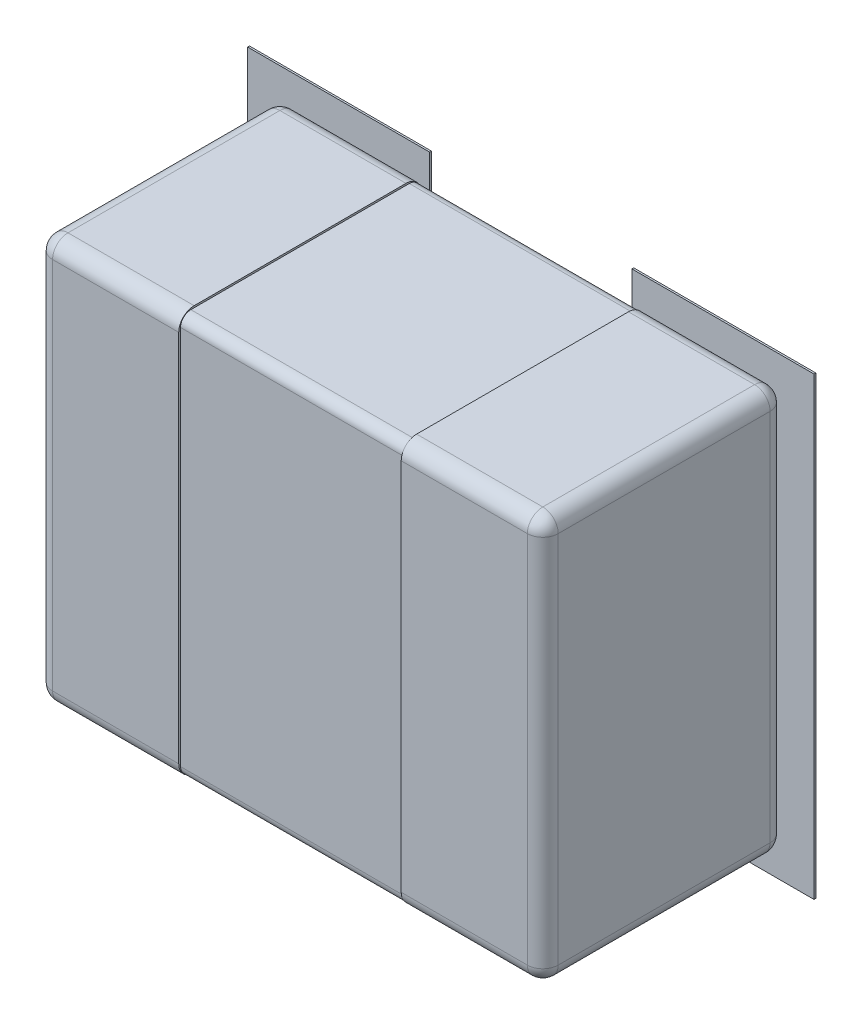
ISO-10303-21;
HEADER;
FILE_DESCRIPTION(('STEP AP214'),'2;1');
FILE_NAME('part.step','',(''),(''),'','','');
FILE_SCHEMA(('AUTOMOTIVE_DESIGN { 1 0 10303 214 1 1 1 1 }'));
ENDSEC;
DATA;
#1=APPLICATION_CONTEXT('core data for automotive mechanical design processes');
#2=APPLICATION_PROTOCOL_DEFINITION('international standard','automotive_design',2000,#1);
#3=PRODUCT_CONTEXT('',#1,'mechanical');
#4=PRODUCT('Part','Part','',(#3));
#5=PRODUCT_RELATED_PRODUCT_CATEGORY('part','',(#4));
#6=PRODUCT_DEFINITION_FORMATION('','',#4);
#7=PRODUCT_DEFINITION_CONTEXT('part definition',#1,'design');
#8=PRODUCT_DEFINITION('design','',#6,#7);
#9=PRODUCT_DEFINITION_SHAPE('','',#8);
#10=(LENGTH_UNIT() NAMED_UNIT(*) SI_UNIT(.MILLI.,.METRE.));
#11=(NAMED_UNIT(*) PLANE_ANGLE_UNIT() SI_UNIT($,.RADIAN.));
#12=(NAMED_UNIT(*) SI_UNIT($,.STERADIAN.) SOLID_ANGLE_UNIT());
#13=UNCERTAINTY_MEASURE_WITH_UNIT(LENGTH_MEASURE(1.E-05),#10,'distance_accuracy_value','');
#14=(GEOMETRIC_REPRESENTATION_CONTEXT(3) GLOBAL_UNCERTAINTY_ASSIGNED_CONTEXT((#13)) GLOBAL_UNIT_ASSIGNED_CONTEXT((#10,
#11,#12)) REPRESENTATION_CONTEXT('',''));
#15=CARTESIAN_POINT('',(0.,0.,0.));
#16=DIRECTION('',(0.,0.,1.));
#17=DIRECTION('',(1.,0.,0.));
#18=AXIS2_PLACEMENT_3D('',#15,#16,#17);
#19=CARTESIAN_POINT('',(-0.550000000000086,-1.00000000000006,0.0851999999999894));
#20=DIRECTION('',(0.,0.,1.));
#21=DIRECTION('',(1.,0.,0.));
#22=AXIS2_PLACEMENT_3D('',#19,#20,#21);
#23=PLANE('',#22);
#24=DIRECTION('',(0.,1.,0.));
#25=VECTOR('',#24,1.);
#26=CARTESIAN_POINT('',(0.500000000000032,1.12500000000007,0.0851999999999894));
#27=LINE('',#26,#25);
#28=CARTESIAN_POINT('',(0.500000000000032,-0.9402000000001,0.0851999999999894));
#29=VERTEX_POINT('',#28);
#30=CARTESIAN_POINT('',(0.500000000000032,0.9402000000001,0.0851999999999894));
#31=VERTEX_POINT('',#30);
#32=EDGE_CURVE('E498',#29,#31,#27,.T.);
#33=ORIENTED_EDGE('',*,*,#32,.F.);
#34=DIRECTION('',(1.,0.,0.));
#35=VECTOR('',#34,1.);
#36=CARTESIAN_POINT('',(-0.550000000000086,-0.9402000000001,0.0851999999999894));
#37=LINE('',#36,#35);
#38=CARTESIAN_POINT('',(-0.500000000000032,-0.9402000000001,0.0851999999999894));
#39=VERTEX_POINT('',#38);
#40=EDGE_CURVE('E499',#39,#29,#37,.T.);
#41=ORIENTED_EDGE('',*,*,#40,.F.);
#42=DIRECTION('',(0.,1.,0.));
#43=VECTOR('',#42,1.);
#44=CARTESIAN_POINT('',(-0.500000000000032,-1.12500000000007,0.0851999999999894));
#45=LINE('',#44,#43);
#46=CARTESIAN_POINT('',(-0.500000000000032,0.9402000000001,0.0851999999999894));
#47=VERTEX_POINT('',#46);
#48=EDGE_CURVE('E541',#47,#39,#45,.F.);
#49=ORIENTED_EDGE('',*,*,#48,.F.);
#50=DIRECTION('',(1.,0.,0.));
#51=VECTOR('',#50,1.);
#52=CARTESIAN_POINT('',(-0.550000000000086,0.9402000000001,0.0851999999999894));
#53=LINE('',#52,#51);
#54=EDGE_CURVE('E502',#31,#47,#53,.F.);
#55=ORIENTED_EDGE('',*,*,#54,.F.);
#56=EDGE_LOOP('',(#33,#41,#49,#55));
#57=FACE_BOUND('',#56,.T.);
#58=ADVANCED_FACE('F16',(#57),#23,.F.);
#59=CARTESIAN_POINT('',(-0.500000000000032,-1.12500000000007,0.0762));
#60=DIRECTION('',(1.,0.,0.));
#61=DIRECTION('',(0.,0.,-1.));
#62=AXIS2_PLACEMENT_3D('',#59,#60,#61);
#63=PLANE('',#62);
#64=DIRECTION('',(0.,1.,0.));
#65=VECTOR('',#64,1.);
#66=CARTESIAN_POINT('',(-0.500000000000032,-1.12500000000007,0.0851999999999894));
#67=LINE('',#66,#65);
#68=CARTESIAN_POINT('',(-0.500000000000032,1.12500000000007,0.0851999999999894));
#69=VERTEX_POINT('',#68);
#70=EDGE_CURVE('E552',#69,#47,#67,.F.);
#71=ORIENTED_EDGE('',*,*,#70,.T.);
#72=ORIENTED_EDGE('',*,*,#48,.T.);
#73=DIRECTION('',(0.,1.,0.));
#74=VECTOR('',#73,1.);
#75=CARTESIAN_POINT('',(-0.500000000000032,-1.12500000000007,0.0851999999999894));
#76=LINE('',#75,#74);
#77=CARTESIAN_POINT('',(-0.500000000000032,-1.12500000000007,0.0851999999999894));
#78=VERTEX_POINT('',#77);
#79=EDGE_CURVE('E535',#39,#78,#76,.F.);
#80=ORIENTED_EDGE('',*,*,#79,.T.);
#81=DIRECTION('',(0.,0.,-1.));
#82=VECTOR('',#81,1.);
#83=CARTESIAN_POINT('',(-0.500000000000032,-1.12500000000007,0.0762));
#84=LINE('',#83,#82);
#85=CARTESIAN_POINT('',(-0.500000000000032,-1.12500000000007,0.0762));
#86=VERTEX_POINT('',#85);
#87=EDGE_CURVE('E569',#78,#86,#84,.T.);
#88=ORIENTED_EDGE('',*,*,#87,.T.);
#89=DIRECTION('',(0.,1.,0.));
#90=VECTOR('',#89,1.);
#91=CARTESIAN_POINT('',(-0.500000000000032,0.,0.0762));
#92=LINE('',#91,#90);
#93=CARTESIAN_POINT('',(-0.500000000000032,1.12500000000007,0.0762));
#94=VERTEX_POINT('',#93);
#95=EDGE_CURVE('E494',#86,#94,#92,.T.);
#96=ORIENTED_EDGE('',*,*,#95,.T.);
#97=DIRECTION('',(0.,0.,-1.));
#98=VECTOR('',#97,1.);
#99=CARTESIAN_POINT('',(-0.500000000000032,1.12500000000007,0.0762));
#100=LINE('',#99,#98);
#101=EDGE_CURVE('E555',#94,#69,#100,.F.);
#102=ORIENTED_EDGE('',*,*,#101,.T.);
#103=EDGE_LOOP('',(#71,#72,#80,#88,#96,#102));
#104=FACE_BOUND('',#103,.T.);
#105=ADVANCED_FACE('F795',(#104),#63,.T.);
#106=CARTESIAN_POINT('',(0.500000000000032,1.12500000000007,0.0762));
#107=DIRECTION('',(-1.,0.,0.));
#108=DIRECTION('',(0.,0.,1.));
#109=AXIS2_PLACEMENT_3D('',#106,#107,#108);
#110=PLANE('',#109);
#111=DIRECTION('',(0.,1.,0.));
#112=VECTOR('',#111,1.);
#113=CARTESIAN_POINT('',(0.500000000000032,1.12500000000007,0.0851999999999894));
#114=LINE('',#113,#112);
#115=CARTESIAN_POINT('',(0.500000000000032,-1.12500000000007,0.0851999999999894));
#116=VERTEX_POINT('',#115);
#117=EDGE_CURVE('E505',#116,#29,#114,.T.);
#118=ORIENTED_EDGE('',*,*,#117,.T.);
#119=ORIENTED_EDGE('',*,*,#32,.T.);
#120=DIRECTION('',(0.,1.,0.));
#121=VECTOR('',#120,1.);
#122=CARTESIAN_POINT('',(0.500000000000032,1.12500000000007,0.0851999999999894));
#123=LINE('',#122,#121);
#124=CARTESIAN_POINT('',(0.500000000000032,1.12500000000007,0.0851999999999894));
#125=VERTEX_POINT('',#124);
#126=EDGE_CURVE('E538',#31,#125,#123,.T.);
#127=ORIENTED_EDGE('',*,*,#126,.T.);
#128=DIRECTION('',(0.,0.,1.));
#129=VECTOR('',#128,1.);
#130=CARTESIAN_POINT('',(0.500000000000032,1.12500000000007,0.0762));
#131=LINE('',#130,#129);
#132=CARTESIAN_POINT('',(0.500000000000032,1.12500000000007,0.0762));
#133=VERTEX_POINT('',#132);
#134=EDGE_CURVE('E522',#125,#133,#131,.F.);
#135=ORIENTED_EDGE('',*,*,#134,.T.);
#136=DIRECTION('',(0.,1.,0.));
#137=VECTOR('',#136,1.);
#138=CARTESIAN_POINT('',(0.500000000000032,0.,0.0762));
#139=LINE('',#138,#137);
#140=CARTESIAN_POINT('',(0.500000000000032,-1.12500000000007,0.0762));
#141=VERTEX_POINT('',#140);
#142=EDGE_CURVE('E493',#133,#141,#139,.F.);
#143=ORIENTED_EDGE('',*,*,#142,.T.);
#144=DIRECTION('',(0.,0.,1.));
#145=VECTOR('',#144,1.);
#146=CARTESIAN_POINT('',(0.500000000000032,-1.12500000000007,0.0762));
#147=LINE('',#146,#145);
#148=EDGE_CURVE('E508',#141,#116,#147,.T.);
#149=ORIENTED_EDGE('',*,*,#148,.T.);
#150=EDGE_LOOP('',(#118,#119,#127,#135,#143,#149));
#151=FACE_BOUND('',#150,.T.);
#152=ADVANCED_FACE('F1238',(#151),#110,.T.);
#153=CARTESIAN_POINT('',(0.,0.,0.0762));
#154=DIRECTION('',(0.,0.,1.));
#155=DIRECTION('',(1.,0.,0.));
#156=AXIS2_PLACEMENT_3D('',#153,#154,#155);
#157=PLANE('',#156);
#158=ORIENTED_EDGE('',*,*,#95,.F.);
#159=DIRECTION('',(1.,0.,0.));
#160=VECTOR('',#159,1.);
#161=CARTESIAN_POINT('',(0.,-1.12500000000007,0.0762));
#162=LINE('',#161,#160);
#163=CARTESIAN_POINT('',(-1.39999999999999,-1.12500000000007,0.0762));
#164=VERTEX_POINT('',#163);
#165=EDGE_CURVE('E495',#164,#86,#162,.T.);
#166=ORIENTED_EDGE('',*,*,#165,.F.);
#167=DIRECTION('',(0.,1.,0.));
#168=VECTOR('',#167,1.);
#169=CARTESIAN_POINT('',(-1.39999999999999,1.12500000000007,0.0762));
#170=LINE('',#169,#168);
#171=CARTESIAN_POINT('',(-1.39999999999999,1.12500000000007,0.0762));
#172=VERTEX_POINT('',#171);
#173=EDGE_CURVE('E474',#172,#164,#170,.F.);
#174=ORIENTED_EDGE('',*,*,#173,.F.);
#175=DIRECTION('',(1.,0.,0.));
#176=VECTOR('',#175,1.);
#177=CARTESIAN_POINT('',(-0.500000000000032,1.12500000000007,0.0762));
#178=LINE('',#177,#176);
#179=EDGE_CURVE('E480',#94,#172,#178,.F.);
#180=ORIENTED_EDGE('',*,*,#179,.F.);
#181=EDGE_LOOP('',(#158,#166,#174,#180));
#182=FACE_BOUND('',#181,.T.);
#183=ADVANCED_FACE('F802',(#182),#157,.F.);
#184=CARTESIAN_POINT('',(0.,0.,0.0762));
#185=DIRECTION('',(0.,0.,1.));
#186=DIRECTION('',(1.,0.,0.));
#187=AXIS2_PLACEMENT_3D('',#184,#185,#186);
#188=PLANE('',#187);
#189=ORIENTED_EDGE('',*,*,#142,.F.);
#190=DIRECTION('',(1.,0.,0.));
#191=VECTOR('',#190,1.);
#192=CARTESIAN_POINT('',(0.,1.12500000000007,0.0762));
#193=LINE('',#192,#191);
#194=CARTESIAN_POINT('',(1.39999999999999,1.12500000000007,0.0762));
#195=VERTEX_POINT('',#194);
#196=EDGE_CURVE('E490',#195,#133,#193,.F.);
#197=ORIENTED_EDGE('',*,*,#196,.F.);
#198=DIRECTION('',(0.,1.,0.));
#199=VECTOR('',#198,1.);
#200=CARTESIAN_POINT('',(1.39999999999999,-1.12500000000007,0.0762));
#201=LINE('',#200,#199);
#202=CARTESIAN_POINT('',(1.39999999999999,-1.12500000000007,0.0762));
#203=VERTEX_POINT('',#202);
#204=EDGE_CURVE('E435',#203,#195,#201,.T.);
#205=ORIENTED_EDGE('',*,*,#204,.F.);
#206=DIRECTION('',(1.,0.,0.));
#207=VECTOR('',#206,1.);
#208=CARTESIAN_POINT('',(0.500000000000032,-1.12500000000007,0.0762));
#209=LINE('',#208,#207);
#210=EDGE_CURVE('E464',#141,#203,#209,.T.);
#211=ORIENTED_EDGE('',*,*,#210,.F.);
#212=EDGE_LOOP('',(#189,#197,#205,#211));
#213=FACE_BOUND('',#212,.T.);
#214=ADVANCED_FACE('F1220',(#213),#188,.F.);
#215=CARTESIAN_POINT('',(-0.500000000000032,1.12500000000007,0.0762));
#216=DIRECTION('',(0.,1.,0.));
#217=DIRECTION('',(0.,0.,1.));
#218=AXIS2_PLACEMENT_3D('',#215,#216,#217);
#219=PLANE('',#218);
#220=ORIENTED_EDGE('',*,*,#101,.F.);
#221=ORIENTED_EDGE('',*,*,#179,.T.);
#222=DIRECTION('',(0.,0.,1.));
#223=VECTOR('',#222,1.);
#224=CARTESIAN_POINT('',(-1.39999999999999,1.12500000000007,0.0762));
#225=LINE('',#224,#223);
#226=CARTESIAN_POINT('',(-1.39999999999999,1.12500000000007,0.0851999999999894));
#227=VERTEX_POINT('',#226);
#228=EDGE_CURVE('E477',#227,#172,#225,.F.);
#229=ORIENTED_EDGE('',*,*,#228,.F.);
#230=DIRECTION('',(1.,0.,0.));
#231=VECTOR('',#230,1.);
#232=CARTESIAN_POINT('',(0.,1.12500000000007,0.0851999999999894));
#233=LINE('',#232,#231);
#234=EDGE_CURVE('E487',#69,#227,#233,.F.);
#235=ORIENTED_EDGE('',*,*,#234,.F.);
#236=EDGE_LOOP('',(#220,#221,#229,#235));
#237=FACE_BOUND('',#236,.T.);
#238=ADVANCED_FACE('F807',(#237),#219,.T.);
#239=CARTESIAN_POINT('',(-1.39999999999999,1.12500000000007,0.0762));
#240=DIRECTION('',(-1.,0.,0.));
#241=DIRECTION('',(0.,0.,1.));
#242=AXIS2_PLACEMENT_3D('',#239,#240,#241);
#243=PLANE('',#242);
#244=ORIENTED_EDGE('',*,*,#228,.T.);
#245=ORIENTED_EDGE('',*,*,#173,.T.);
#246=DIRECTION('',(0.,0.,-1.));
#247=VECTOR('',#246,1.);
#248=CARTESIAN_POINT('',(-1.39999999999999,-1.12500000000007,0.0762));
#249=LINE('',#248,#247);
#250=CARTESIAN_POINT('',(-1.39999999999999,-1.12500000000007,0.0851999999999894));
#251=VERTEX_POINT('',#250);
#252=EDGE_CURVE('E471',#251,#164,#249,.T.);
#253=ORIENTED_EDGE('',*,*,#252,.F.);
#254=DIRECTION('',(0.,1.,0.));
#255=VECTOR('',#254,1.);
#256=CARTESIAN_POINT('',(-1.39999999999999,0.,0.0851999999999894));
#257=LINE('',#256,#255);
#258=EDGE_CURVE('E564',#227,#251,#257,.F.);
#259=ORIENTED_EDGE('',*,*,#258,.F.);
#260=EDGE_LOOP('',(#244,#245,#253,#259));
#261=FACE_BOUND('',#260,.T.);
#262=ADVANCED_FACE('F783',(#261),#243,.T.);
#263=CARTESIAN_POINT('',(-1.39999999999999,-1.12500000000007,0.0762));
#264=DIRECTION('',(0.,-1.,0.));
#265=DIRECTION('',(0.,0.,-1.));
#266=AXIS2_PLACEMENT_3D('',#263,#264,#265);
#267=PLANE('',#266);
#268=ORIENTED_EDGE('',*,*,#252,.T.);
#269=ORIENTED_EDGE('',*,*,#165,.T.);
#270=ORIENTED_EDGE('',*,*,#87,.F.);
#271=DIRECTION('',(1.,0.,0.));
#272=VECTOR('',#271,1.);
#273=CARTESIAN_POINT('',(0.,-1.12500000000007,0.0851999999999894));
#274=LINE('',#273,#272);
#275=EDGE_CURVE('E467',#251,#78,#274,.T.);
#276=ORIENTED_EDGE('',*,*,#275,.F.);
#277=EDGE_LOOP('',(#268,#269,#270,#276));
#278=FACE_BOUND('',#277,.T.);
#279=ADVANCED_FACE('F787',(#278),#267,.T.);
#280=CARTESIAN_POINT('',(0.500000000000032,-1.12500000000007,0.0762));
#281=DIRECTION('',(0.,-1.,0.));
#282=DIRECTION('',(0.,0.,-1.));
#283=AXIS2_PLACEMENT_3D('',#280,#281,#282);
#284=PLANE('',#283);
#285=ORIENTED_EDGE('',*,*,#148,.F.);
#286=ORIENTED_EDGE('',*,*,#210,.T.);
#287=DIRECTION('',(0.,0.,-1.));
#288=VECTOR('',#287,1.);
#289=CARTESIAN_POINT('',(1.39999999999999,-1.12500000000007,0.0762));
#290=LINE('',#289,#288);
#291=CARTESIAN_POINT('',(1.39999999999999,-1.12500000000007,0.0851999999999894));
#292=VERTEX_POINT('',#291);
#293=EDGE_CURVE('E461',#292,#203,#290,.T.);
#294=ORIENTED_EDGE('',*,*,#293,.F.);
#295=DIRECTION('',(1.,0.,0.));
#296=VECTOR('',#295,1.);
#297=CARTESIAN_POINT('',(0.,-1.12500000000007,0.0851999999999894));
#298=LINE('',#297,#296);
#299=EDGE_CURVE('E446',#116,#292,#298,.T.);
#300=ORIENTED_EDGE('',*,*,#299,.F.);
#301=EDGE_LOOP('',(#285,#286,#294,#300));
#302=FACE_BOUND('',#301,.T.);
#303=ADVANCED_FACE('F1308',(#302),#284,.T.);
#304=CARTESIAN_POINT('',(1.39999999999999,-1.12500000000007,0.0762));
#305=DIRECTION('',(1.,0.,0.));
#306=DIRECTION('',(0.,0.,-1.));
#307=AXIS2_PLACEMENT_3D('',#304,#305,#306);
#308=PLANE('',#307);
#309=ORIENTED_EDGE('',*,*,#293,.T.);
#310=ORIENTED_EDGE('',*,*,#204,.T.);
#311=DIRECTION('',(0.,0.,1.));
#312=VECTOR('',#311,1.);
#313=CARTESIAN_POINT('',(1.39999999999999,1.12500000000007,0.0762));
#314=LINE('',#313,#312);
#315=CARTESIAN_POINT('',(1.39999999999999,1.12500000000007,0.0851999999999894));
#316=VERTEX_POINT('',#315);
#317=EDGE_CURVE('E432',#316,#195,#314,.F.);
#318=ORIENTED_EDGE('',*,*,#317,.F.);
#319=DIRECTION('',(0.,1.,0.));
#320=VECTOR('',#319,1.);
#321=CARTESIAN_POINT('',(1.39999999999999,0.,0.0851999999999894));
#322=LINE('',#321,#320);
#323=EDGE_CURVE('E517',#292,#316,#322,.T.);
#324=ORIENTED_EDGE('',*,*,#323,.F.);
#325=EDGE_LOOP('',(#309,#310,#318,#324));
#326=FACE_BOUND('',#325,.T.);
#327=ADVANCED_FACE('F1315',(#326),#308,.T.);
#328=CARTESIAN_POINT('',(1.39999999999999,1.12500000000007,0.0762));
#329=DIRECTION('',(0.,1.,0.));
#330=DIRECTION('',(0.,0.,1.));
#331=AXIS2_PLACEMENT_3D('',#328,#329,#330);
#332=PLANE('',#331);
#333=ORIENTED_EDGE('',*,*,#317,.T.);
#334=ORIENTED_EDGE('',*,*,#196,.T.);
#335=ORIENTED_EDGE('',*,*,#134,.F.);
#336=DIRECTION('',(1.,0.,0.));
#337=VECTOR('',#336,1.);
#338=CARTESIAN_POINT('',(0.,1.12500000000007,0.0851999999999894));
#339=LINE('',#338,#337);
#340=EDGE_CURVE('E456',#316,#125,#339,.F.);
#341=ORIENTED_EDGE('',*,*,#340,.F.);
#342=EDGE_LOOP('',(#333,#334,#335,#341));
#343=FACE_BOUND('',#342,.T.);
#344=ADVANCED_FACE('F250',(#343),#332,.T.);
#345=CARTESIAN_POINT('',(0.,0.,0.0851999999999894));
#346=DIRECTION('',(0.,0.,1.));
#347=DIRECTION('',(1.,0.,0.));
#348=AXIS2_PLACEMENT_3D('',#345,#346,#347);
#349=PLANE('',#348);
#350=DIRECTION('',(1.,0.,0.));
#351=VECTOR('',#350,1.);
#352=CARTESIAN_POINT('',(0.,-0.9402000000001,0.0851999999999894));
#353=LINE('',#352,#351);
#354=CARTESIAN_POINT('',(-0.550000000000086,-0.9402000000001,0.0851999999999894));
#355=VERTEX_POINT('',#354);
#356=EDGE_CURVE('E465',#39,#355,#353,.F.);
#357=ORIENTED_EDGE('',*,*,#356,.T.);
#358=DIRECTION('',(0.,1.,0.));
#359=VECTOR('',#358,1.);
#360=CARTESIAN_POINT('',(-0.550000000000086,0.,0.0851999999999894));
#361=LINE('',#360,#359);
#362=CARTESIAN_POINT('',(-0.550000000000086,-0.959724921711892,0.0851999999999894));
#363=VERTEX_POINT('',#362);
#364=EDGE_CURVE('E99',#355,#363,#361,.F.);
#365=ORIENTED_EDGE('',*,*,#364,.T.);
#366=DIRECTION('',(1.,0.,0.));
#367=VECTOR('',#366,1.);
#368=CARTESIAN_POINT('',(0.,-0.959724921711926,0.0851999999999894));
#369=LINE('',#368,#367);
#370=CARTESIAN_POINT('',(-1.17380000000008,-0.959724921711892,0.0851999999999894));
#371=VERTEX_POINT('',#370);
#372=EDGE_CURVE('E93',#363,#371,#369,.F.);
#373=ORIENTED_EDGE('',*,*,#372,.T.);
#374=CARTESIAN_POINT('',(-1.17380000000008,-0.959724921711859,0.0851999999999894));
#375=CARTESIAN_POINT('',(-1.17784927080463,-0.959751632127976,0.0851999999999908));
#376=CARTESIAN_POINT('',(-1.18188203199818,-0.959044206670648,0.0851999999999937));
#377=CARTESIAN_POINT('',(-1.18950066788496,-0.956355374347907,0.0851999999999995));
#378=CARTESIAN_POINT('',(-1.19308654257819,-0.954373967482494,0.0852000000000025));
#379=CARTESIAN_POINT('',(-1.19939753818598,-0.949331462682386,0.0852000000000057));
#380=CARTESIAN_POINT('',(-1.20212265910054,-0.946270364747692,0.085200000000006));
#381=CARTESIAN_POINT('',(-1.20640246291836,-0.939415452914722,0.0852000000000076));
#382=CARTESIAN_POINT('',(-1.20795714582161,-0.935621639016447,0.0852000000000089));
#383=CARTESIAN_POINT('',(-1.20943509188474,-0.929097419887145,0.0852000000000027));
#384=CARTESIAN_POINT('',(-1.20973457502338,-0.926447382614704,0.0851999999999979));
#385=CARTESIAN_POINT('',(-1.20972492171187,-0.923800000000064,0.0851999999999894));
#386=B_SPLINE_CURVE_WITH_KNOTS('',3,(#374,#375,#376,#377,#378,#379,#380,#381,#382,#383,#384,
#385),.UNSPECIFIED.,.F.,.F.,(4,2,2,2,2,4),(0.,0.0120625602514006,0.0241251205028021,
0.036187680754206,0.0482502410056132,0.0561849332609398),.UNSPECIFIED.);
#387=CARTESIAN_POINT('',(-1.2097249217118,-0.923800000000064,0.0851999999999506));
#388=VERTEX_POINT('',#387);
#389=EDGE_CURVE('E19',#371,#388,#386,.T.);
#390=ORIENTED_EDGE('',*,*,#389,.T.);
#391=DIRECTION('',(0.,1.,0.));
#392=VECTOR('',#391,1.);
#393=CARTESIAN_POINT('',(-1.20972492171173,-4.05809999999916,0.0851999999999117));
#394=LINE('',#393,#392);
#395=CARTESIAN_POINT('',(-1.2097249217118,0.923800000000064,0.0851999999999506));
#396=VERTEX_POINT('',#395);
#397=EDGE_CURVE('E214',#396,#388,#394,.F.);
#398=ORIENTED_EDGE('',*,*,#397,.F.);
#399=CARTESIAN_POINT('',(-1.20972492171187,0.923800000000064,0.0851999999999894));
#400=CARTESIAN_POINT('',(-1.20975163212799,0.927849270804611,0.0851999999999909));
#401=CARTESIAN_POINT('',(-1.20904420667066,0.931882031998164,0.0851999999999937));
#402=CARTESIAN_POINT('',(-1.20635537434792,0.939500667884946,0.0851999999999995));
#403=CARTESIAN_POINT('',(-1.20437396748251,0.943086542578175,0.0852000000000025));
#404=CARTESIAN_POINT('',(-1.1993314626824,0.949397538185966,0.0852000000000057));
#405=CARTESIAN_POINT('',(-1.19627036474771,0.952122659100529,0.085200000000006));
#406=CARTESIAN_POINT('',(-1.18941545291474,0.956402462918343,0.0852000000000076));
#407=CARTESIAN_POINT('',(-1.18562163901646,0.957957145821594,0.0852000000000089));
#408=CARTESIAN_POINT('',(-1.17909741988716,0.959435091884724,0.0852000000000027));
#409=CARTESIAN_POINT('',(-1.17644738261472,0.959734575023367,0.085199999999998));
#410=CARTESIAN_POINT('',(-1.17380000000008,0.959724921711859,0.0851999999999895));
#411=B_SPLINE_CURVE_WITH_KNOTS('',3,(#399,#400,#401,#402,#403,#404,#405,#406,#407,#408,#409,
#410),.UNSPECIFIED.,.F.,.F.,(4,2,2,2,2,4),(0.,0.0120625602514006,0.0241251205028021,
0.0361876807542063,0.0482502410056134,0.05618493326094),.UNSPECIFIED.);
#412=CARTESIAN_POINT('',(-1.17380000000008,0.959724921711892,0.0851999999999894));
#413=VERTEX_POINT('',#412);
#414=EDGE_CURVE('E253',#396,#413,#411,.T.);
#415=ORIENTED_EDGE('',*,*,#414,.T.);
#416=DIRECTION('',(1.,0.,0.));
#417=VECTOR('',#416,1.);
#418=CARTESIAN_POINT('',(0.,0.959724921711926,0.0851999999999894));
#419=LINE('',#418,#417);
#420=CARTESIAN_POINT('',(-0.550000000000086,0.959724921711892,0.0851999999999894));
#421=VERTEX_POINT('',#420);
#422=EDGE_CURVE('E258',#413,#421,#419,.T.);
#423=ORIENTED_EDGE('',*,*,#422,.T.);
#424=DIRECTION('',(0.,1.,0.));
#425=VECTOR('',#424,1.);
#426=CARTESIAN_POINT('',(-0.550000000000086,0.,0.0851999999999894));
#427=LINE('',#426,#425);
#428=CARTESIAN_POINT('',(-0.550000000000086,0.9402000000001,0.0851999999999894));
#429=VERTEX_POINT('',#428);
#430=EDGE_CURVE('E481',#421,#429,#427,.F.);
#431=ORIENTED_EDGE('',*,*,#430,.T.);
#432=DIRECTION('',(1.,0.,0.));
#433=VECTOR('',#432,1.);
#434=CARTESIAN_POINT('',(0.,0.9402000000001,0.0851999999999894));
#435=LINE('',#434,#433);
#436=EDGE_CURVE('E484',#429,#47,#435,.T.);
#437=ORIENTED_EDGE('',*,*,#436,.T.);
#438=ORIENTED_EDGE('',*,*,#70,.F.);
#439=ORIENTED_EDGE('',*,*,#234,.T.);
#440=ORIENTED_EDGE('',*,*,#258,.T.);
#441=ORIENTED_EDGE('',*,*,#275,.T.);
#442=ORIENTED_EDGE('',*,*,#79,.F.);
#443=EDGE_LOOP('',(#357,#365,#373,#390,#398,#415,#423,#431,#437,#438,#439,#440,#441,#442));
#444=FACE_BOUND('',#443,.T.);
#445=ADVANCED_FACE('F243',(#444),#349,.T.);
#446=CARTESIAN_POINT('',(0.,0.,0.0851999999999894));
#447=DIRECTION('',(0.,0.,1.));
#448=DIRECTION('',(1.,0.,0.));
#449=AXIS2_PLACEMENT_3D('',#446,#447,#448);
#450=PLANE('',#449);
#451=DIRECTION('',(1.,0.,0.));
#452=VECTOR('',#451,1.);
#453=CARTESIAN_POINT('',(0.,-0.959724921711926,0.0851999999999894));
#454=LINE('',#453,#452);
#455=CARTESIAN_POINT('',(1.17380000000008,-0.959724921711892,0.0851999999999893));
#456=VERTEX_POINT('',#455);
#457=CARTESIAN_POINT('',(0.550000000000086,-0.959724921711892,0.0851999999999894));
#458=VERTEX_POINT('',#457);
#459=EDGE_CURVE('E227',#456,#458,#454,.F.);
#460=ORIENTED_EDGE('',*,*,#459,.T.);
#461=DIRECTION('',(0.,1.,0.));
#462=VECTOR('',#461,1.);
#463=CARTESIAN_POINT('',(0.550000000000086,0.,0.0851999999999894));
#464=LINE('',#463,#462);
#465=CARTESIAN_POINT('',(0.550000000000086,-0.9402000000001,0.0851999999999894));
#466=VERTEX_POINT('',#465);
#467=EDGE_CURVE('E219',#458,#466,#464,.T.);
#468=ORIENTED_EDGE('',*,*,#467,.T.);
#469=DIRECTION('',(1.,0.,0.));
#470=VECTOR('',#469,1.);
#471=CARTESIAN_POINT('',(0.,-0.9402000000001,0.0851999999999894));
#472=LINE('',#471,#470);
#473=EDGE_CURVE('E443',#466,#29,#472,.F.);
#474=ORIENTED_EDGE('',*,*,#473,.T.);
#475=ORIENTED_EDGE('',*,*,#117,.F.);
#476=ORIENTED_EDGE('',*,*,#299,.T.);
#477=ORIENTED_EDGE('',*,*,#323,.T.);
#478=ORIENTED_EDGE('',*,*,#340,.T.);
#479=ORIENTED_EDGE('',*,*,#126,.F.);
#480=DIRECTION('',(1.,0.,0.));
#481=VECTOR('',#480,1.);
#482=CARTESIAN_POINT('',(0.,0.9402000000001,0.0851999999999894));
#483=LINE('',#482,#481);
#484=CARTESIAN_POINT('',(0.550000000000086,0.9402000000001,0.0851999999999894));
#485=VERTEX_POINT('',#484);
#486=EDGE_CURVE('E453',#31,#485,#483,.T.);
#487=ORIENTED_EDGE('',*,*,#486,.T.);
#488=DIRECTION('',(0.,1.,0.));
#489=VECTOR('',#488,1.);
#490=CARTESIAN_POINT('',(0.550000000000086,0.,0.0851999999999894));
#491=LINE('',#490,#489);
#492=CARTESIAN_POINT('',(0.550000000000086,0.959724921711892,0.0851999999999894));
#493=VERTEX_POINT('',#492);
#494=EDGE_CURVE('E449',#485,#493,#491,.T.);
#495=ORIENTED_EDGE('',*,*,#494,.T.);
#496=DIRECTION('',(1.,0.,0.));
#497=VECTOR('',#496,1.);
#498=CARTESIAN_POINT('',(0.,0.959724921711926,0.0851999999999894));
#499=LINE('',#498,#497);
#500=CARTESIAN_POINT('',(1.17380000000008,0.959724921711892,0.0851999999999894));
#501=VERTEX_POINT('',#500);
#502=EDGE_CURVE('E452',#493,#501,#499,.T.);
#503=ORIENTED_EDGE('',*,*,#502,.T.);
#504=CARTESIAN_POINT('',(1.17380000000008,0.959724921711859,0.0851999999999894));
#505=CARTESIAN_POINT('',(1.17784927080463,0.959751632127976,0.0851999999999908));
#506=CARTESIAN_POINT('',(1.18188203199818,0.959044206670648,0.0851999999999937));
#507=CARTESIAN_POINT('',(1.18950066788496,0.956355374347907,0.0851999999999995));
#508=CARTESIAN_POINT('',(1.19308654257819,0.954373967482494,0.0852000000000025));
#509=CARTESIAN_POINT('',(1.19939753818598,0.949331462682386,0.0852000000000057));
#510=CARTESIAN_POINT('',(1.20212265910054,0.946270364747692,0.085200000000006));
#511=CARTESIAN_POINT('',(1.20640246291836,0.939415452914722,0.0852000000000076));
#512=CARTESIAN_POINT('',(1.20795714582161,0.935621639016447,0.0852000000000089));
#513=CARTESIAN_POINT('',(1.20943509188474,0.929097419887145,0.0852000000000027));
#514=CARTESIAN_POINT('',(1.20973457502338,0.926447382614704,0.0851999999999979));
#515=CARTESIAN_POINT('',(1.20972492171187,0.923800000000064,0.0851999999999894));
#516=B_SPLINE_CURVE_WITH_KNOTS('',3,(#504,#505,#506,#507,#508,#509,#510,#511,#512,#513,#514,
#515),.UNSPECIFIED.,.F.,.F.,(4,2,2,2,2,4),(0.,0.0120625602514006,0.0241251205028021,
0.036187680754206,0.0482502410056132,0.0561849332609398),.UNSPECIFIED.);
#517=CARTESIAN_POINT('',(1.2097249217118,0.923800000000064,0.0851999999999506));
#518=VERTEX_POINT('',#517);
#519=EDGE_CURVE('E228',#501,#518,#516,.T.);
#520=ORIENTED_EDGE('',*,*,#519,.T.);
#521=DIRECTION('',(0.,-1.,0.));
#522=VECTOR('',#521,1.);
#523=CARTESIAN_POINT('',(1.20972492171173,4.05809999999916,0.0851999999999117));
#524=LINE('',#523,#522);
#525=CARTESIAN_POINT('',(1.2097249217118,-0.923800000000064,0.0851999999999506));
#526=VERTEX_POINT('',#525);
#527=EDGE_CURVE('E211',#526,#518,#524,.F.);
#528=ORIENTED_EDGE('',*,*,#527,.F.);
#529=CARTESIAN_POINT('',(1.20972492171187,-0.923800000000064,0.0851999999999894));
#530=CARTESIAN_POINT('',(1.209751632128,-0.927849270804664,0.0852000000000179));
#531=CARTESIAN_POINT('',(1.20904420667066,-0.931882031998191,0.0852000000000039));
#532=CARTESIAN_POINT('',(1.2063553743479,-0.939500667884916,0.0851999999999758));
#533=CARTESIAN_POINT('',(1.20437396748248,-0.943086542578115,0.0851999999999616));
#534=CARTESIAN_POINT('',(1.19933146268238,-0.949397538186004,0.0852000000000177));
#535=CARTESIAN_POINT('',(1.1962703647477,-0.952122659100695,0.0852000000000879));
#536=CARTESIAN_POINT('',(1.1894154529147,-0.95640246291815,0.0851999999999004));
#537=CARTESIAN_POINT('',(1.18562163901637,-0.957957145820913,0.0851999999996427));
#538=CARTESIAN_POINT('',(1.17909741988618,-0.959435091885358,0.0852000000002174));
#539=CARTESIAN_POINT('',(1.17644738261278,-0.959734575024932,0.085200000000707));
#540=CARTESIAN_POINT('',(1.17379999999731,-0.959724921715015,0.0852000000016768));
#541=B_SPLINE_CURVE_WITH_KNOTS('',3,(#529,#530,#531,#532,#533,#534,#535,#536,#537,#538,#539,
#540),.UNSPECIFIED.,.F.,.F.,(4,2,2,2,2,4),(0.,0.0120625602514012,0.0241251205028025,
0.0361876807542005,0.0482502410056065,0.0561849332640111),.UNSPECIFIED.);
#542=EDGE_CURVE('E220',#526,#456,#541,.T.);
#543=ORIENTED_EDGE('',*,*,#542,.T.);
#544=EDGE_LOOP('',(#460,#468,#474,#475,#476,#477,#478,#479,#487,#495,#503,#520,#528,#543));
#545=FACE_BOUND('',#544,.T.);
#546=ADVANCED_FACE('F238',(#545),#450,.T.);
#547=CARTESIAN_POINT('',(-1.17380000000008,-4.05809999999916,0.1524));
#548=DIRECTION('',(0.,1.,0.));
#549=DIRECTION('',(0.,0.,1.));
#550=AXIS2_PLACEMENT_3D('',#547,#548,#549);
#551=CYLINDRICAL_SURFACE('',#550,0.0762);
#552=CARTESIAN_POINT('',(-1.17380000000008,0.923800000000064,0.1524));
#553=DIRECTION('',(0.,1.,0.));
#554=DIRECTION('',(0.,0.,1.));
#555=AXIS2_PLACEMENT_3D('',#552,#553,#554);
#556=CIRCLE('',#555,0.0762);
#557=CARTESIAN_POINT('',(-1.25000000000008,0.923800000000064,0.1524));
#558=VERTEX_POINT('',#557);
#559=EDGE_CURVE('E215',#558,#396,#556,.F.);
#560=ORIENTED_EDGE('',*,*,#559,.T.);
#561=ORIENTED_EDGE('',*,*,#397,.T.);
#562=CARTESIAN_POINT('',(-1.17380000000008,-0.923800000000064,0.1524));
#563=DIRECTION('',(0.,1.,0.));
#564=DIRECTION('',(0.,0.,1.));
#565=AXIS2_PLACEMENT_3D('',#562,#563,#564);
#566=CIRCLE('',#565,0.0762);
#567=CARTESIAN_POINT('',(-1.25000000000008,-0.923800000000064,0.1524));
#568=VERTEX_POINT('',#567);
#569=EDGE_CURVE('E217',#388,#568,#566,.T.);
#570=ORIENTED_EDGE('',*,*,#569,.T.);
#571=DIRECTION('',(0.,1.,0.));
#572=VECTOR('',#571,1.);
#573=CARTESIAN_POINT('',(-1.25000000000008,1.00000000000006,0.1524));
#574=LINE('',#573,#572);
#575=EDGE_CURVE('E176',#558,#568,#574,.F.);
#576=ORIENTED_EDGE('',*,*,#575,.F.);
#577=EDGE_LOOP('',(#560,#561,#570,#576));
#578=FACE_BOUND('',#577,.T.);
#579=ADVANCED_FACE('F242',(#578),#551,.T.);
#580=CARTESIAN_POINT('',(1.17380000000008,4.05809999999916,0.1524));
#581=DIRECTION('',(0.,-1.,0.));
#582=DIRECTION('',(0.,0.,-1.));
#583=AXIS2_PLACEMENT_3D('',#580,#581,#582);
#584=CYLINDRICAL_SURFACE('',#583,0.0762);
#585=CARTESIAN_POINT('',(1.17380000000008,-0.923800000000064,0.1524));
#586=DIRECTION('',(0.,-1.,0.));
#587=DIRECTION('',(0.,0.,-1.));
#588=AXIS2_PLACEMENT_3D('',#585,#586,#587);
#589=CIRCLE('',#588,0.0762);
#590=CARTESIAN_POINT('',(1.25000000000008,-0.923800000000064,0.1524));
#591=VERTEX_POINT('',#590);
#592=EDGE_CURVE('E209',#591,#526,#589,.F.);
#593=ORIENTED_EDGE('',*,*,#592,.T.);
#594=ORIENTED_EDGE('',*,*,#527,.T.);
#595=CARTESIAN_POINT('',(1.17380000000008,0.923800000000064,0.1524));
#596=DIRECTION('',(0.,-1.,0.));
#597=DIRECTION('',(0.,0.,-1.));
#598=AXIS2_PLACEMENT_3D('',#595,#596,#597);
#599=CIRCLE('',#598,0.0762);
#600=CARTESIAN_POINT('',(1.25000000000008,0.923800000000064,0.1524));
#601=VERTEX_POINT('',#600);
#602=EDGE_CURVE('E212',#518,#601,#599,.T.);
#603=ORIENTED_EDGE('',*,*,#602,.T.);
#604=DIRECTION('',(0.,1.,0.));
#605=VECTOR('',#604,1.);
#606=CARTESIAN_POINT('',(1.25000000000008,-1.00000000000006,0.1524));
#607=LINE('',#606,#605);
#608=EDGE_CURVE('E177',#591,#601,#607,.T.);
#609=ORIENTED_EDGE('',*,*,#608,.F.);
#610=EDGE_LOOP('',(#593,#594,#603,#609));
#611=FACE_BOUND('',#610,.T.);
#612=ADVANCED_FACE('F314',(#611),#584,.T.);
#613=CARTESIAN_POINT('',(-1.25000000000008,1.00000000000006,0.0762));
#614=DIRECTION('',(-1.,0.,0.));
#615=DIRECTION('',(0.,0.,1.));
#616=AXIS2_PLACEMENT_3D('',#613,#614,#615);
#617=PLANE('',#616);
#618=DIRECTION('',(0.,0.,-1.));
#619=VECTOR('',#618,1.);
#620=CARTESIAN_POINT('',(-1.25000000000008,-0.923800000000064,2.8402804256));
#621=LINE('',#620,#619);
#622=CARTESIAN_POINT('',(-1.25000000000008,-0.923800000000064,1.199896));
#623=VERTEX_POINT('',#622);
#624=EDGE_CURVE('E169',#623,#568,#621,.T.);
#625=ORIENTED_EDGE('',*,*,#624,.F.);
#626=DIRECTION('',(0.,-1.,0.));
#627=VECTOR('',#626,1.);
#628=CARTESIAN_POINT('',(-1.25000000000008,4.05809999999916,1.199896));
#629=LINE('',#628,#627);
#630=CARTESIAN_POINT('',(-1.25000000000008,0.923800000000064,1.199896));
#631=VERTEX_POINT('',#630);
#632=EDGE_CURVE('E173',#631,#623,#629,.T.);
#633=ORIENTED_EDGE('',*,*,#632,.F.);
#634=DIRECTION('',(0.,0.,1.));
#635=VECTOR('',#634,1.);
#636=CARTESIAN_POINT('',(-1.25000000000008,0.923800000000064,0.0762));
#637=LINE('',#636,#635);
#638=EDGE_CURVE('E759',#631,#558,#637,.F.);
#639=ORIENTED_EDGE('',*,*,#638,.T.);
#640=ORIENTED_EDGE('',*,*,#575,.T.);
#641=EDGE_LOOP('',(#625,#633,#639,#640));
#642=FACE_BOUND('',#641,.T.);
#643=ADVANCED_FACE('F171',(#642),#617,.T.);
#644=CARTESIAN_POINT('',(1.25000000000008,-1.00000000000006,0.0762));
#645=DIRECTION('',(1.,0.,0.));
#646=DIRECTION('',(0.,0.,-1.));
#647=AXIS2_PLACEMENT_3D('',#644,#645,#646);
#648=PLANE('',#647);
#649=DIRECTION('',(0.,0.,-1.));
#650=VECTOR('',#649,1.);
#651=CARTESIAN_POINT('',(1.25000000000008,-0.923800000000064,0.0762));
#652=LINE('',#651,#650);
#653=CARTESIAN_POINT('',(1.25000000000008,-0.923800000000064,1.199896));
#654=VERTEX_POINT('',#653);
#655=EDGE_CURVE('E756',#654,#591,#652,.T.);
#656=ORIENTED_EDGE('',*,*,#655,.T.);
#657=ORIENTED_EDGE('',*,*,#608,.T.);
#658=DIRECTION('',(0.,0.,-1.));
#659=VECTOR('',#658,1.);
#660=CARTESIAN_POINT('',(1.25000000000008,0.923800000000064,2.8402804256));
#661=LINE('',#660,#659);
#662=CARTESIAN_POINT('',(1.25000000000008,0.923800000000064,1.199896));
#663=VERTEX_POINT('',#662);
#664=EDGE_CURVE('E277',#663,#601,#661,.T.);
#665=ORIENTED_EDGE('',*,*,#664,.F.);
#666=DIRECTION('',(0.,1.,0.));
#667=VECTOR('',#666,1.);
#668=CARTESIAN_POINT('',(1.25000000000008,-4.05809999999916,1.199896));
#669=LINE('',#668,#667);
#670=EDGE_CURVE('E302',#654,#663,#669,.T.);
#671=ORIENTED_EDGE('',*,*,#670,.F.);
#672=EDGE_LOOP('',(#656,#657,#665,#671));
#673=FACE_BOUND('',#672,.T.);
#674=ADVANCED_FACE('F308',(#673),#648,.T.);
#675=CARTESIAN_POINT('',(-1.17380000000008,-0.923800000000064,0.1524));
#676=DIRECTION('',(-0.707106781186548,-0.707106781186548,0.));
#677=DIRECTION('',(0.,0.,-1.));
#678=AXIS2_PLACEMENT_3D('',#675,#676,#677);
#679=SPHERICAL_SURFACE('',#678,0.0762);
#680=ORIENTED_EDGE('',*,*,#569,.F.);
#681=ORIENTED_EDGE('',*,*,#389,.F.);
#682=CARTESIAN_POINT('',(-1.17380000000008,-0.923800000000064,0.1524));
#683=DIRECTION('',(-1.,0.,0.));
#684=DIRECTION('',(0.,0.,1.));
#685=AXIS2_PLACEMENT_3D('',#682,#683,#684);
#686=CIRCLE('',#685,0.0762);
#687=CARTESIAN_POINT('',(-1.17380000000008,-1.00000000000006,0.1524));
#688=VERTEX_POINT('',#687);
#689=EDGE_CURVE('E423',#688,#371,#686,.F.);
#690=ORIENTED_EDGE('',*,*,#689,.F.);
#691=CARTESIAN_POINT('',(-1.17380000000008,-0.923800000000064,0.1524));
#692=DIRECTION('',(0.,0.,-1.));
#693=DIRECTION('',(-1.,0.,0.));
#694=AXIS2_PLACEMENT_3D('',#691,#692,#693);
#695=CIRCLE('',#694,0.0762);
#696=CARTESIAN_POINT('',(-1.22768153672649,-0.977681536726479,0.1524));
#697=VERTEX_POINT('',#696);
#698=EDGE_CURVE('E191',#697,#688,#695,.F.);
#699=ORIENTED_EDGE('',*,*,#698,.F.);
#700=CARTESIAN_POINT('',(-1.17380000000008,-0.923800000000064,0.1524));
#701=DIRECTION('',(0.,0.,-1.));
#702=DIRECTION('',(-1.,0.,0.));
#703=AXIS2_PLACEMENT_3D('',#700,#701,#702);
#704=CIRCLE('',#703,0.0762);
#705=EDGE_CURVE('E39',#568,#697,#704,.F.);
#706=ORIENTED_EDGE('',*,*,#705,.F.);
#707=EDGE_LOOP('',(#680,#681,#690,#699,#706));
#708=FACE_BOUND('',#707,.T.);
#709=ADVANCED_FACE('F304',(#708),#679,.T.);
#710=CARTESIAN_POINT('',(-1.17380000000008,-0.923800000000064,2.8402804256));
#711=DIRECTION('',(0.,0.,-1.));
#712=DIRECTION('',(-1.,0.,0.));
#713=AXIS2_PLACEMENT_3D('',#710,#711,#712);
#714=CYLINDRICAL_SURFACE('',#713,0.0762);
#715=ORIENTED_EDGE('',*,*,#698,.T.);
#716=DIRECTION('',(0.,0.,-1.));
#717=VECTOR('',#716,1.);
#718=CARTESIAN_POINT('',(-1.17380000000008,-1.00000000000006,0.0762));
#719=LINE('',#718,#717);
#720=CARTESIAN_POINT('',(-1.17380000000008,-1.00000000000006,1.199896));
#721=VERTEX_POINT('',#720);
#722=EDGE_CURVE('E184',#721,#688,#719,.T.);
#723=ORIENTED_EDGE('',*,*,#722,.F.);
#724=CARTESIAN_POINT('',(-1.17380000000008,-0.923800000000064,1.199896));
#725=DIRECTION('',(0.,0.,-1.));
#726=DIRECTION('',(-1.,0.,0.));
#727=AXIS2_PLACEMENT_3D('',#724,#725,#726);
#728=CIRCLE('',#727,0.0762);
#729=EDGE_CURVE('E181',#623,#721,#728,.F.);
#730=ORIENTED_EDGE('',*,*,#729,.F.);
#731=ORIENTED_EDGE('',*,*,#624,.T.);
#732=ORIENTED_EDGE('',*,*,#705,.T.);
#733=EDGE_LOOP('',(#715,#723,#730,#731,#732));
#734=FACE_BOUND('',#733,.T.);
#735=ADVANCED_FACE('F182',(#734),#714,.T.);
#736=CARTESIAN_POINT('',(-1.17380000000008,-0.923800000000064,1.199896));
#737=DIRECTION('',(0.,-0.707106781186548,0.707106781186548));
#738=DIRECTION('',(-1.,0.,0.));
#739=AXIS2_PLACEMENT_3D('',#736,#737,#738);
#740=SPHERICAL_SURFACE('',#739,0.0762);
#741=CARTESIAN_POINT('',(-1.17380000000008,-0.923800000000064,1.199896));
#742=DIRECTION('',(1.,0.,0.));
#743=DIRECTION('',(0.,0.,-1.));
#744=AXIS2_PLACEMENT_3D('',#741,#742,#743);
#745=CIRCLE('',#744,0.0762);
#746=CARTESIAN_POINT('',(-1.17380000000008,-0.977681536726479,1.25377753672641));
#747=VERTEX_POINT('',#746);
#748=EDGE_CURVE('E682',#747,#721,#745,.T.);
#749=ORIENTED_EDGE('',*,*,#748,.F.);
#750=CARTESIAN_POINT('',(-1.17380000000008,-0.923800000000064,1.199896));
#751=DIRECTION('',(1.,0.,0.));
#752=DIRECTION('',(0.,0.,-1.));
#753=AXIS2_PLACEMENT_3D('',#750,#751,#752);
#754=CIRCLE('',#753,0.0762);
#755=CARTESIAN_POINT('',(-1.17380000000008,-0.923800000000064,1.276096));
#756=VERTEX_POINT('',#755);
#757=EDGE_CURVE('E202',#756,#747,#754,.T.);
#758=ORIENTED_EDGE('',*,*,#757,.F.);
#759=CARTESIAN_POINT('',(-1.17380000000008,-0.923800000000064,1.199896));
#760=DIRECTION('',(0.,-1.,0.));
#761=DIRECTION('',(0.,0.,-1.));
#762=AXIS2_PLACEMENT_3D('',#759,#760,#761);
#763=CIRCLE('',#762,0.0762);
#764=EDGE_CURVE('E190',#623,#756,#763,.F.);
#765=ORIENTED_EDGE('',*,*,#764,.F.);
#766=ORIENTED_EDGE('',*,*,#729,.T.);
#767=EDGE_LOOP('',(#749,#758,#765,#766));
#768=FACE_BOUND('',#767,.T.);
#769=ADVANCED_FACE('F201',(#768),#740,.T.);
#770=CARTESIAN_POINT('',(-1.17380000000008,4.05809999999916,1.199896));
#771=DIRECTION('',(0.,-1.,0.));
#772=DIRECTION('',(0.,0.,-1.));
#773=AXIS2_PLACEMENT_3D('',#770,#771,#772);
#774=CYLINDRICAL_SURFACE('',#773,0.0762);
#775=CARTESIAN_POINT('',(-1.17380000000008,0.923800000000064,1.199896));
#776=DIRECTION('',(0.,-1.,0.));
#777=DIRECTION('',(0.,0.,-1.));
#778=AXIS2_PLACEMENT_3D('',#775,#776,#777);
#779=CIRCLE('',#778,0.0762);
#780=CARTESIAN_POINT('',(-1.2276815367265,0.923800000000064,1.25377753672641));
#781=VERTEX_POINT('',#780);
#782=EDGE_CURVE('E198',#631,#781,#779,.F.);
#783=ORIENTED_EDGE('',*,*,#782,.F.);
#784=ORIENTED_EDGE('',*,*,#632,.T.);
#785=ORIENTED_EDGE('',*,*,#764,.T.);
#786=DIRECTION('',(0.,1.,0.));
#787=VECTOR('',#786,1.);
#788=CARTESIAN_POINT('',(-1.17380000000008,0.,1.276096));
#789=LINE('',#788,#787);
#790=CARTESIAN_POINT('',(-1.17380000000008,0.923800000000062,1.276096));
#791=VERTEX_POINT('',#790);
#792=EDGE_CURVE('E279',#791,#756,#789,.F.);
#793=ORIENTED_EDGE('',*,*,#792,.F.);
#794=CARTESIAN_POINT('',(-1.17380000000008,0.923800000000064,1.199896));
#795=DIRECTION('',(0.,1.,0.));
#796=DIRECTION('',(-0.707106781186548,0.,0.707106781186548));
#797=AXIS2_PLACEMENT_3D('',#794,#795,#796);
#798=CIRCLE('',#797,0.0762);
#799=EDGE_CURVE('E285',#781,#791,#798,.T.);
#800=ORIENTED_EDGE('',*,*,#799,.F.);
#801=EDGE_LOOP('',(#783,#784,#785,#793,#800));
#802=FACE_BOUND('',#801,.T.);
#803=ADVANCED_FACE('F194',(#802),#774,.T.);
#804=CARTESIAN_POINT('',(-1.17380000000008,0.923800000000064,1.199896));
#805=DIRECTION('',(-0.707106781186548,0.,0.707106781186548));
#806=DIRECTION('',(0.,1.,0.));
#807=AXIS2_PLACEMENT_3D('',#804,#805,#806);
#808=SPHERICAL_SURFACE('',#807,0.0762);
#809=ORIENTED_EDGE('',*,*,#782,.T.);
#810=ORIENTED_EDGE('',*,*,#799,.T.);
#811=CARTESIAN_POINT('',(-1.17380000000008,0.923800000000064,1.199896));
#812=DIRECTION('',(-1.,0.,0.));
#813=DIRECTION('',(0.,0.,1.));
#814=AXIS2_PLACEMENT_3D('',#811,#812,#813);
#815=CIRCLE('',#814,0.0762);
#816=CARTESIAN_POINT('',(-1.17380000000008,1.00000000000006,1.199896));
#817=VERTEX_POINT('',#816);
#818=EDGE_CURVE('E678',#817,#791,#815,.F.);
#819=ORIENTED_EDGE('',*,*,#818,.F.);
#820=CARTESIAN_POINT('',(-1.17380000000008,0.923800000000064,1.199896));
#821=DIRECTION('',(0.,0.,-1.));
#822=DIRECTION('',(-1.,0.,0.));
#823=AXIS2_PLACEMENT_3D('',#820,#821,#822);
#824=CIRCLE('',#823,0.0762);
#825=EDGE_CURVE('E697',#631,#817,#824,.T.);
#826=ORIENTED_EDGE('',*,*,#825,.F.);
#827=EDGE_LOOP('',(#809,#810,#819,#826));
#828=FACE_BOUND('',#827,.T.);
#829=ADVANCED_FACE('F287',(#828),#808,.T.);
#830=CARTESIAN_POINT('',(-1.17380000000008,0.923800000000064,2.8402804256));
#831=DIRECTION('',(0.,0.,-1.));
#832=DIRECTION('',(-1.,0.,0.));
#833=AXIS2_PLACEMENT_3D('',#830,#831,#832);
#834=CYLINDRICAL_SURFACE('',#833,0.0762);
#835=CARTESIAN_POINT('',(-1.17380000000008,0.923800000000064,0.1524));
#836=DIRECTION('',(0.,0.,-1.));
#837=DIRECTION('',(-1.,0.,0.));
#838=AXIS2_PLACEMENT_3D('',#835,#836,#837);
#839=CIRCLE('',#838,0.0762);
#840=CARTESIAN_POINT('',(-1.22768153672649,0.977681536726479,0.1524));
#841=VERTEX_POINT('',#840);
#842=EDGE_CURVE('E278',#558,#841,#839,.T.);
#843=ORIENTED_EDGE('',*,*,#842,.F.);
#844=ORIENTED_EDGE('',*,*,#638,.F.);
#845=ORIENTED_EDGE('',*,*,#825,.T.);
#846=DIRECTION('',(0.,0.,1.));
#847=VECTOR('',#846,1.);
#848=CARTESIAN_POINT('',(-1.17380000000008,1.00000000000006,0.0762));
#849=LINE('',#848,#847);
#850=CARTESIAN_POINT('',(-1.17380000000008,1.00000000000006,0.152399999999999));
#851=VERTEX_POINT('',#850);
#852=EDGE_CURVE('E274',#851,#817,#849,.T.);
#853=ORIENTED_EDGE('',*,*,#852,.F.);
#854=CARTESIAN_POINT('',(-1.17380000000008,0.923800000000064,0.1524));
#855=DIRECTION('',(0.,0.,-1.));
#856=DIRECTION('',(-0.707106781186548,0.707106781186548,0.));
#857=AXIS2_PLACEMENT_3D('',#854,#855,#856);
#858=CIRCLE('',#857,0.0762);
#859=EDGE_CURVE('E275',#841,#851,#858,.T.);
#860=ORIENTED_EDGE('',*,*,#859,.F.);
#861=EDGE_LOOP('',(#843,#844,#845,#853,#860));
#862=FACE_BOUND('',#861,.T.);
#863=ADVANCED_FACE('F265',(#862),#834,.T.);
#864=CARTESIAN_POINT('',(-1.17380000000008,0.923800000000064,0.1524));
#865=DIRECTION('',(-0.707106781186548,0.707106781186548,0.));
#866=DIRECTION('',(0.,0.,-1.));
#867=AXIS2_PLACEMENT_3D('',#864,#865,#866);
#868=SPHERICAL_SURFACE('',#867,0.0762);
#869=CARTESIAN_POINT('',(-1.17380000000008,0.923800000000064,0.1524));
#870=DIRECTION('',(1.,0.,0.));
#871=DIRECTION('',(0.,0.,-1.));
#872=AXIS2_PLACEMENT_3D('',#869,#870,#871);
#873=CIRCLE('',#872,0.0762);
#874=EDGE_CURVE('E673',#413,#851,#873,.T.);
#875=ORIENTED_EDGE('',*,*,#874,.F.);
#876=ORIENTED_EDGE('',*,*,#414,.F.);
#877=ORIENTED_EDGE('',*,*,#559,.F.);
#878=ORIENTED_EDGE('',*,*,#842,.T.);
#879=ORIENTED_EDGE('',*,*,#859,.T.);
#880=EDGE_LOOP('',(#875,#876,#877,#878,#879));
#881=FACE_BOUND('',#880,.T.);
#882=ADVANCED_FACE('F259',(#881),#868,.T.);
#883=CARTESIAN_POINT('',(1.17380000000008,0.923800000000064,0.1524));
#884=DIRECTION('',(0.707106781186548,0.707106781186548,0.));
#885=DIRECTION('',(0.,0.,-1.));
#886=AXIS2_PLACEMENT_3D('',#883,#884,#885);
#887=SPHERICAL_SURFACE('',#886,0.0762);
#888=ORIENTED_EDGE('',*,*,#519,.F.);
#889=CARTESIAN_POINT('',(1.17380000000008,0.923800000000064,0.1524));
#890=DIRECTION('',(1.,0.,0.));
#891=DIRECTION('',(0.,0.,-1.));
#892=AXIS2_PLACEMENT_3D('',#889,#890,#891);
#893=CIRCLE('',#892,0.0762);
#894=CARTESIAN_POINT('',(1.17380000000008,1.00000000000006,0.1524));
#895=VERTEX_POINT('',#894);
#896=EDGE_CURVE('E668',#895,#501,#893,.F.);
#897=ORIENTED_EDGE('',*,*,#896,.F.);
#898=CARTESIAN_POINT('',(1.17380000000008,0.923800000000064,0.1524));
#899=DIRECTION('',(0.,0.,-1.));
#900=DIRECTION('',(-1.,0.,0.));
#901=AXIS2_PLACEMENT_3D('',#898,#899,#900);
#902=CIRCLE('',#901,0.0762);
#903=CARTESIAN_POINT('',(1.22768153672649,0.977681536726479,0.1524));
#904=VERTEX_POINT('',#903);
#905=EDGE_CURVE('E694',#904,#895,#902,.F.);
#906=ORIENTED_EDGE('',*,*,#905,.F.);
#907=CARTESIAN_POINT('',(1.17380000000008,0.923800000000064,0.1524));
#908=DIRECTION('',(0.,0.,-1.));
#909=DIRECTION('',(-1.,0.,0.));
#910=AXIS2_PLACEMENT_3D('',#907,#908,#909);
#911=CIRCLE('',#910,0.0762);
#912=EDGE_CURVE('E696',#601,#904,#911,.F.);
#913=ORIENTED_EDGE('',*,*,#912,.F.);
#914=ORIENTED_EDGE('',*,*,#602,.F.);
#915=EDGE_LOOP('',(#888,#897,#906,#913,#914));
#916=FACE_BOUND('',#915,.T.);
#917=ADVANCED_FACE('F264',(#916),#887,.T.);
#918=CARTESIAN_POINT('',(1.17380000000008,0.923800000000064,2.8402804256));
#919=DIRECTION('',(0.,0.,-1.));
#920=DIRECTION('',(-1.,0.,0.));
#921=AXIS2_PLACEMENT_3D('',#918,#919,#920);
#922=CYLINDRICAL_SURFACE('',#921,0.0762);
#923=ORIENTED_EDGE('',*,*,#905,.T.);
#924=DIRECTION('',(0.,0.,1.));
#925=VECTOR('',#924,1.);
#926=CARTESIAN_POINT('',(1.17380000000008,1.00000000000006,0.0762));
#927=LINE('',#926,#925);
#928=CARTESIAN_POINT('',(1.17380000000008,1.00000000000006,1.199896));
#929=VERTEX_POINT('',#928);
#930=EDGE_CURVE('E747',#929,#895,#927,.F.);
#931=ORIENTED_EDGE('',*,*,#930,.F.);
#932=CARTESIAN_POINT('',(1.17380000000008,0.923800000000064,1.199896));
#933=DIRECTION('',(0.,0.,-1.));
#934=DIRECTION('',(-1.,0.,0.));
#935=AXIS2_PLACEMENT_3D('',#932,#933,#934);
#936=CIRCLE('',#935,0.0762);
#937=EDGE_CURVE('E692',#663,#929,#936,.F.);
#938=ORIENTED_EDGE('',*,*,#937,.F.);
#939=ORIENTED_EDGE('',*,*,#664,.T.);
#940=ORIENTED_EDGE('',*,*,#912,.T.);
#941=EDGE_LOOP('',(#923,#931,#938,#939,#940));
#942=FACE_BOUND('',#941,.T.);
#943=ADVANCED_FACE('F743',(#942),#922,.T.);
#944=CARTESIAN_POINT('',(1.17380000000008,0.923800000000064,1.199896));
#945=DIRECTION('',(0.,0.707106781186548,0.707106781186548));
#946=DIRECTION('',(1.,0.,0.));
#947=AXIS2_PLACEMENT_3D('',#944,#945,#946);
#948=SPHERICAL_SURFACE('',#947,0.0762);
#949=CARTESIAN_POINT('',(1.17380000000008,0.923800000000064,1.199896));
#950=DIRECTION('',(0.,1.,0.));
#951=DIRECTION('',(0.,0.,1.));
#952=AXIS2_PLACEMENT_3D('',#949,#950,#951);
#953=CIRCLE('',#952,0.0762);
#954=CARTESIAN_POINT('',(1.17380000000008,0.923800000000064,1.276096));
#955=VERTEX_POINT('',#954);
#956=EDGE_CURVE('E690',#663,#955,#953,.F.);
#957=ORIENTED_EDGE('',*,*,#956,.F.);
#958=ORIENTED_EDGE('',*,*,#937,.T.);
#959=CARTESIAN_POINT('',(1.17380000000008,0.923800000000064,1.199896));
#960=DIRECTION('',(-1.,0.,0.));
#961=DIRECTION('',(0.,0.,1.));
#962=AXIS2_PLACEMENT_3D('',#959,#960,#961);
#963=CIRCLE('',#962,0.0762);
#964=CARTESIAN_POINT('',(1.17380000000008,0.977681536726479,1.25377753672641));
#965=VERTEX_POINT('',#964);
#966=EDGE_CURVE('E663',#965,#929,#963,.T.);
#967=ORIENTED_EDGE('',*,*,#966,.F.);
#968=CARTESIAN_POINT('',(1.17380000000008,0.923800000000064,1.199896));
#969=DIRECTION('',(-1.,0.,0.));
#970=DIRECTION('',(0.,0.,1.));
#971=AXIS2_PLACEMENT_3D('',#968,#969,#970);
#972=CIRCLE('',#971,0.0762);
#973=EDGE_CURVE('E667',#955,#965,#972,.T.);
#974=ORIENTED_EDGE('',*,*,#973,.F.);
#975=EDGE_LOOP('',(#957,#958,#967,#974));
#976=FACE_BOUND('',#975,.T.);
#977=ADVANCED_FACE('F739',(#976),#948,.T.);
#978=CARTESIAN_POINT('',(1.17380000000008,-4.05809999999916,1.199896));
#979=DIRECTION('',(0.,1.,0.));
#980=DIRECTION('',(0.,0.,1.));
#981=AXIS2_PLACEMENT_3D('',#978,#979,#980);
#982=CYLINDRICAL_SURFACE('',#981,0.0762);
#983=CARTESIAN_POINT('',(1.17380000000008,-0.923800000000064,1.199896));
#984=DIRECTION('',(0.,1.,0.));
#985=DIRECTION('',(0.,0.,1.));
#986=AXIS2_PLACEMENT_3D('',#983,#984,#985);
#987=CIRCLE('',#986,0.0762);
#988=CARTESIAN_POINT('',(1.17380000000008,-0.923800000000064,1.276096));
#989=VERTEX_POINT('',#988);
#990=EDGE_CURVE('E688',#654,#989,#987,.F.);
#991=ORIENTED_EDGE('',*,*,#990,.F.);
#992=ORIENTED_EDGE('',*,*,#670,.T.);
#993=ORIENTED_EDGE('',*,*,#956,.T.);
#994=DIRECTION('',(0.,1.,0.));
#995=VECTOR('',#994,1.);
#996=CARTESIAN_POINT('',(1.17380000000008,0.,1.276096));
#997=LINE('',#996,#995);
#998=EDGE_CURVE('E662',#989,#955,#997,.T.);
#999=ORIENTED_EDGE('',*,*,#998,.F.);
#1000=EDGE_LOOP('',(#991,#992,#993,#999));
#1001=FACE_BOUND('',#1000,.T.);
#1002=ADVANCED_FACE('F735',(#1001),#982,.T.);
#1003=CARTESIAN_POINT('',(1.17380000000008,-0.923800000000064,1.199896));
#1004=DIRECTION('',(0.707106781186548,-0.707106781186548,0.));
#1005=DIRECTION('',(0.,0.,1.));
#1006=AXIS2_PLACEMENT_3D('',#1003,#1004,#1005);
#1007=SPHERICAL_SURFACE('',#1006,0.0762);
#1008=CARTESIAN_POINT('',(1.17380000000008,-0.923800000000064,1.199896));
#1009=DIRECTION('',(0.,0.,-1.));
#1010=DIRECTION('',(-1.,0.,0.));
#1011=AXIS2_PLACEMENT_3D('',#1008,#1009,#1010);
#1012=CIRCLE('',#1011,0.0762);
#1013=CARTESIAN_POINT('',(1.22768153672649,-0.977681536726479,1.199896));
#1014=VERTEX_POINT('',#1013);
#1015=EDGE_CURVE('E687',#654,#1014,#1012,.T.);
#1016=ORIENTED_EDGE('',*,*,#1015,.F.);
#1017=ORIENTED_EDGE('',*,*,#990,.T.);
#1018=CARTESIAN_POINT('',(1.17380000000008,-0.923800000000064,1.199896));
#1019=DIRECTION('',(1.,0.,0.));
#1020=DIRECTION('',(0.,0.,-1.));
#1021=AXIS2_PLACEMENT_3D('',#1018,#1019,#1020);
#1022=CIRCLE('',#1021,0.0762);
#1023=CARTESIAN_POINT('',(1.17380000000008,-1.00000000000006,1.199896));
#1024=VERTEX_POINT('',#1023);
#1025=EDGE_CURVE('E658',#1024,#989,#1022,.F.);
#1026=ORIENTED_EDGE('',*,*,#1025,.F.);
#1027=CARTESIAN_POINT('',(1.17380000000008,-0.923800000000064,1.199896));
#1028=DIRECTION('',(0.,0.,-1.));
#1029=DIRECTION('',(-1.,0.,0.));
#1030=AXIS2_PLACEMENT_3D('',#1027,#1028,#1029);
#1031=CIRCLE('',#1030,0.0762);
#1032=EDGE_CURVE('E685',#1014,#1024,#1031,.T.);
#1033=ORIENTED_EDGE('',*,*,#1032,.F.);
#1034=EDGE_LOOP('',(#1016,#1017,#1026,#1033));
#1035=FACE_BOUND('',#1034,.T.);
#1036=ADVANCED_FACE('F732',(#1035),#1007,.T.);
#1037=CARTESIAN_POINT('',(1.17380000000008,-0.923800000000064,2.8402804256));
#1038=DIRECTION('',(0.,0.,-1.));
#1039=DIRECTION('',(-1.,0.,0.));
#1040=AXIS2_PLACEMENT_3D('',#1037,#1038,#1039);
#1041=CYLINDRICAL_SURFACE('',#1040,0.0762);
#1042=CARTESIAN_POINT('',(1.17380000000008,-0.923800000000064,0.1524));
#1043=DIRECTION('',(0.,0.,-1.));
#1044=DIRECTION('',(-1.,0.,0.));
#1045=AXIS2_PLACEMENT_3D('',#1042,#1043,#1044);
#1046=CIRCLE('',#1045,0.0762);
#1047=CARTESIAN_POINT('',(1.17380000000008,-1.00000000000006,0.1524));
#1048=VERTEX_POINT('',#1047);
#1049=EDGE_CURVE('E427',#591,#1048,#1046,.T.);
#1050=ORIENTED_EDGE('',*,*,#1049,.F.);
#1051=ORIENTED_EDGE('',*,*,#655,.F.);
#1052=ORIENTED_EDGE('',*,*,#1015,.T.);
#1053=ORIENTED_EDGE('',*,*,#1032,.T.);
#1054=DIRECTION('',(0.,0.,-1.));
#1055=VECTOR('',#1054,1.);
#1056=CARTESIAN_POINT('',(1.17380000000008,-1.00000000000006,0.0762));
#1057=LINE('',#1056,#1055);
#1058=EDGE_CURVE('E718',#1048,#1024,#1057,.F.);
#1059=ORIENTED_EDGE('',*,*,#1058,.F.);
#1060=EDGE_LOOP('',(#1050,#1051,#1052,#1053,#1059));
#1061=FACE_BOUND('',#1060,.T.);
#1062=ADVANCED_FACE('F419',(#1061),#1041,.T.);
#1063=CARTESIAN_POINT('',(1.17380000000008,-0.923800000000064,0.1524));
#1064=DIRECTION('',(0.,-0.707106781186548,-0.707106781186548));
#1065=DIRECTION('',(1.,0.,0.));
#1066=AXIS2_PLACEMENT_3D('',#1063,#1064,#1065);
#1067=SPHERICAL_SURFACE('',#1066,0.0762);
#1068=CARTESIAN_POINT('',(1.17380000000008,-0.923800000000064,0.1524));
#1069=DIRECTION('',(-1.,0.,0.));
#1070=DIRECTION('',(0.,0.,1.));
#1071=AXIS2_PLACEMENT_3D('',#1068,#1069,#1070);
#1072=CIRCLE('',#1071,0.0762);
#1073=CARTESIAN_POINT('',(1.17380000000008,-0.977681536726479,0.0985184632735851));
#1074=VERTEX_POINT('',#1073);
#1075=EDGE_CURVE('E657',#456,#1074,#1072,.T.);
#1076=ORIENTED_EDGE('',*,*,#1075,.F.);
#1077=ORIENTED_EDGE('',*,*,#542,.F.);
#1078=ORIENTED_EDGE('',*,*,#592,.F.);
#1079=ORIENTED_EDGE('',*,*,#1049,.T.);
#1080=CARTESIAN_POINT('',(1.17380000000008,-0.923800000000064,0.1524));
#1081=DIRECTION('',(-1.,0.,0.));
#1082=DIRECTION('',(0.,0.,1.));
#1083=AXIS2_PLACEMENT_3D('',#1080,#1081,#1082);
#1084=CIRCLE('',#1083,0.0762);
#1085=EDGE_CURVE('E653',#1074,#1048,#1084,.T.);
#1086=ORIENTED_EDGE('',*,*,#1085,.F.);
#1087=EDGE_LOOP('',(#1076,#1077,#1078,#1079,#1086));
#1088=FACE_BOUND('',#1087,.T.);
#1089=ADVANCED_FACE('F233',(#1088),#1067,.T.);
#1090=CARTESIAN_POINT('',(5.05008000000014,-0.923800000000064,0.1524));
#1091=DIRECTION('',(-1.,0.,0.));
#1092=DIRECTION('',(0.,0.,1.));
#1093=AXIS2_PLACEMENT_3D('',#1090,#1091,#1092);
#1094=CYLINDRICAL_SURFACE('',#1093,0.0762);
#1095=ORIENTED_EDGE('',*,*,#689,.T.);
#1096=ORIENTED_EDGE('',*,*,#372,.F.);
#1097=CARTESIAN_POINT('',(-0.550000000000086,-0.923800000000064,0.1524));
#1098=DIRECTION('',(-1.,0.,0.));
#1099=DIRECTION('',(0.,0.,1.));
#1100=AXIS2_PLACEMENT_3D('',#1097,#1098,#1099);
#1101=CIRCLE('',#1100,0.0762);
#1102=CARTESIAN_POINT('',(-0.550000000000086,-1.00000000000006,0.1524));
#1103=VERTEX_POINT('',#1102);
#1104=EDGE_CURVE('E650',#363,#1103,#1101,.T.);
#1105=ORIENTED_EDGE('',*,*,#1104,.T.);
#1106=DIRECTION('',(1.,0.,0.));
#1107=VECTOR('',#1106,1.);
#1108=CARTESIAN_POINT('',(-1.25000000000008,-1.00000000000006,0.1524));
#1109=LINE('',#1108,#1107);
#1110=EDGE_CURVE('E426',#688,#1103,#1109,.T.);
#1111=ORIENTED_EDGE('',*,*,#1110,.F.);
#1112=EDGE_LOOP('',(#1095,#1096,#1105,#1111));
#1113=FACE_BOUND('',#1112,.T.);
#1114=ADVANCED_FACE('F412',(#1113),#1094,.T.);
#1115=CARTESIAN_POINT('',(-1.25000000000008,-1.00000000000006,0.0762));
#1116=DIRECTION('',(0.,-1.,0.));
#1117=DIRECTION('',(0.,0.,-1.));
#1118=AXIS2_PLACEMENT_3D('',#1115,#1116,#1117);
#1119=PLANE('',#1118);
#1120=ORIENTED_EDGE('',*,*,#722,.T.);
#1121=ORIENTED_EDGE('',*,*,#1110,.T.);
#1122=DIRECTION('',(0.,0.,1.));
#1123=VECTOR('',#1122,1.);
#1124=CARTESIAN_POINT('',(-0.550000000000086,-1.00000000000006,0.0762));
#1125=LINE('',#1124,#1123);
#1126=CARTESIAN_POINT('',(-0.550000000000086,-1.00000000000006,1.199896));
#1127=VERTEX_POINT('',#1126);
#1128=EDGE_CURVE('E649',#1103,#1127,#1125,.T.);
#1129=ORIENTED_EDGE('',*,*,#1128,.T.);
#1130=DIRECTION('',(1.,0.,0.));
#1131=VECTOR('',#1130,1.);
#1132=CARTESIAN_POINT('',(-5.05008000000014,-1.00000000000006,1.199896));
#1133=LINE('',#1132,#1131);
#1134=EDGE_CURVE('E282',#721,#1127,#1133,.T.);
#1135=ORIENTED_EDGE('',*,*,#1134,.F.);
#1136=EDGE_LOOP('',(#1120,#1121,#1129,#1135));
#1137=FACE_BOUND('',#1136,.T.);
#1138=ADVANCED_FACE('F409',(#1137),#1119,.T.);
#1139=CARTESIAN_POINT('',(-5.05008000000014,-0.923800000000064,1.199896));
#1140=DIRECTION('',(1.,0.,0.));
#1141=DIRECTION('',(0.,0.,-1.));
#1142=AXIS2_PLACEMENT_3D('',#1139,#1140,#1141);
#1143=CYLINDRICAL_SURFACE('',#1142,0.0762);
#1144=ORIENTED_EDGE('',*,*,#1134,.T.);
#1145=CARTESIAN_POINT('',(-0.550000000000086,-0.923800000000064,1.199896));
#1146=DIRECTION('',(1.,0.,0.));
#1147=DIRECTION('',(0.,0.,-1.));
#1148=AXIS2_PLACEMENT_3D('',#1145,#1146,#1147);
#1149=CIRCLE('',#1148,0.0762);
#1150=CARTESIAN_POINT('',(-0.550000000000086,-0.923800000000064,1.276096));
#1151=VERTEX_POINT('',#1150);
#1152=EDGE_CURVE('E646',#1127,#1151,#1149,.F.);
#1153=ORIENTED_EDGE('',*,*,#1152,.T.);
#1154=DIRECTION('',(1.,0.,0.));
#1155=VECTOR('',#1154,1.);
#1156=CARTESIAN_POINT('',(0.,-0.923800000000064,1.276096));
#1157=LINE('',#1156,#1155);
#1158=EDGE_CURVE('E281',#756,#1151,#1157,.T.);
#1159=ORIENTED_EDGE('',*,*,#1158,.F.);
#1160=ORIENTED_EDGE('',*,*,#757,.T.);
#1161=ORIENTED_EDGE('',*,*,#748,.T.);
#1162=EDGE_LOOP('',(#1144,#1153,#1159,#1160,#1161));
#1163=FACE_BOUND('',#1162,.T.);
#1164=ADVANCED_FACE('F405',(#1163),#1143,.T.);
#1165=CARTESIAN_POINT('',(0.,0.,1.276096));
#1166=DIRECTION('',(0.,0.,1.));
#1167=DIRECTION('',(1.,0.,0.));
#1168=AXIS2_PLACEMENT_3D('',#1165,#1166,#1167);
#1169=PLANE('',#1168);
#1170=DIRECTION('',(0.,1.,0.));
#1171=VECTOR('',#1170,1.);
#1172=CARTESIAN_POINT('',(-0.550000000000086,-1.00000000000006,1.276096));
#1173=LINE('',#1172,#1171);
#1174=CARTESIAN_POINT('',(-0.550000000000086,0.923800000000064,1.276096));
#1175=VERTEX_POINT('',#1174);
#1176=EDGE_CURVE('E645',#1151,#1175,#1173,.T.);
#1177=ORIENTED_EDGE('',*,*,#1176,.T.);
#1178=DIRECTION('',(-1.,0.,0.));
#1179=VECTOR('',#1178,1.);
#1180=CARTESIAN_POINT('',(5.05008000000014,0.923800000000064,1.276096));
#1181=LINE('',#1180,#1179);
#1182=EDGE_CURVE('E681',#791,#1175,#1181,.F.);
#1183=ORIENTED_EDGE('',*,*,#1182,.F.);
#1184=ORIENTED_EDGE('',*,*,#792,.T.);
#1185=ORIENTED_EDGE('',*,*,#1158,.T.);
#1186=EDGE_LOOP('',(#1177,#1183,#1184,#1185));
#1187=FACE_BOUND('',#1186,.T.);
#1188=ADVANCED_FACE('F401',(#1187),#1169,.T.);
#1189=CARTESIAN_POINT('',(5.05008000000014,0.923800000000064,1.199896));
#1190=DIRECTION('',(-1.,0.,0.));
#1191=DIRECTION('',(0.,0.,1.));
#1192=AXIS2_PLACEMENT_3D('',#1189,#1190,#1191);
#1193=CYLINDRICAL_SURFACE('',#1192,0.0762);
#1194=CARTESIAN_POINT('',(-0.550000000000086,0.923800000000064,1.199896));
#1195=DIRECTION('',(-1.,0.,0.));
#1196=DIRECTION('',(0.,0.,1.));
#1197=AXIS2_PLACEMENT_3D('',#1194,#1195,#1196);
#1198=CIRCLE('',#1197,0.0762);
#1199=CARTESIAN_POINT('',(-0.550000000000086,1.00000000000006,1.199896));
#1200=VERTEX_POINT('',#1199);
#1201=EDGE_CURVE('E642',#1175,#1200,#1198,.T.);
#1202=ORIENTED_EDGE('',*,*,#1201,.T.);
#1203=DIRECTION('',(1.,0.,0.));
#1204=VECTOR('',#1203,1.);
#1205=CARTESIAN_POINT('',(1.25000000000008,1.00000000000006,1.199896));
#1206=LINE('',#1205,#1204);
#1207=EDGE_CURVE('E677',#817,#1200,#1206,.T.);
#1208=ORIENTED_EDGE('',*,*,#1207,.F.);
#1209=ORIENTED_EDGE('',*,*,#818,.T.);
#1210=ORIENTED_EDGE('',*,*,#1182,.T.);
#1211=EDGE_LOOP('',(#1202,#1208,#1209,#1210));
#1212=FACE_BOUND('',#1211,.T.);
#1213=ADVANCED_FACE('F397',(#1212),#1193,.T.);
#1214=CARTESIAN_POINT('',(1.25000000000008,1.00000000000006,0.0762));
#1215=DIRECTION('',(0.,1.,0.));
#1216=DIRECTION('',(0.,0.,1.));
#1217=AXIS2_PLACEMENT_3D('',#1214,#1215,#1216);
#1218=PLANE('',#1217);
#1219=ORIENTED_EDGE('',*,*,#852,.T.);
#1220=ORIENTED_EDGE('',*,*,#1207,.T.);
#1221=DIRECTION('',(0.,0.,1.));
#1222=VECTOR('',#1221,1.);
#1223=CARTESIAN_POINT('',(-0.550000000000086,1.00000000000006,0.0762));
#1224=LINE('',#1223,#1222);
#1225=CARTESIAN_POINT('',(-0.550000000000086,1.00000000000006,0.1524));
#1226=VERTEX_POINT('',#1225);
#1227=EDGE_CURVE('E641',#1200,#1226,#1224,.F.);
#1228=ORIENTED_EDGE('',*,*,#1227,.T.);
#1229=DIRECTION('',(1.,0.,0.));
#1230=VECTOR('',#1229,1.);
#1231=CARTESIAN_POINT('',(-5.05008000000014,1.00000000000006,0.1524));
#1232=LINE('',#1231,#1230);
#1233=EDGE_CURVE('E676',#851,#1226,#1232,.T.);
#1234=ORIENTED_EDGE('',*,*,#1233,.F.);
#1235=EDGE_LOOP('',(#1219,#1220,#1228,#1234));
#1236=FACE_BOUND('',#1235,.T.);
#1237=ADVANCED_FACE('F393',(#1236),#1218,.T.);
#1238=CARTESIAN_POINT('',(-5.05008000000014,0.923800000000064,0.1524));
#1239=DIRECTION('',(1.,0.,0.));
#1240=DIRECTION('',(0.,0.,-1.));
#1241=AXIS2_PLACEMENT_3D('',#1238,#1239,#1240);
#1242=CYLINDRICAL_SURFACE('',#1241,0.0762);
#1243=CARTESIAN_POINT('',(-0.550000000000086,0.923800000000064,0.1524));
#1244=DIRECTION('',(1.,0.,0.));
#1245=DIRECTION('',(0.,0.,-1.));
#1246=AXIS2_PLACEMENT_3D('',#1243,#1244,#1245);
#1247=CIRCLE('',#1246,0.0762);
#1248=EDGE_CURVE('E638',#1226,#421,#1247,.F.);
#1249=ORIENTED_EDGE('',*,*,#1248,.T.);
#1250=ORIENTED_EDGE('',*,*,#422,.F.);
#1251=ORIENTED_EDGE('',*,*,#874,.T.);
#1252=ORIENTED_EDGE('',*,*,#1233,.T.);
#1253=EDGE_LOOP('',(#1249,#1250,#1251,#1252));
#1254=FACE_BOUND('',#1253,.T.);
#1255=ADVANCED_FACE('F389',(#1254),#1242,.T.);
#1256=CARTESIAN_POINT('',(-5.05008000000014,-0.9402000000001,0.135999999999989));
#1257=DIRECTION('',(1.,0.,0.));
#1258=DIRECTION('',(0.,0.,-1.));
#1259=AXIS2_PLACEMENT_3D('',#1256,#1257,#1258);
#1260=CYLINDRICAL_SURFACE('',#1259,0.0508);
#1261=CARTESIAN_POINT('',(-0.550000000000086,-0.9402000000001,0.135999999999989));
#1262=DIRECTION('',(1.,0.,0.));
#1263=DIRECTION('',(0.,0.,-1.));
#1264=AXIS2_PLACEMENT_3D('',#1261,#1262,#1263);
#1265=CIRCLE('',#1264,0.0508);
#1266=CARTESIAN_POINT('',(-0.550000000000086,-0.9910000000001,0.135999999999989));
#1267=VERTEX_POINT('',#1266);
#1268=EDGE_CURVE('E630',#1267,#355,#1265,.T.);
#1269=ORIENTED_EDGE('',*,*,#1268,.T.);
#1270=ORIENTED_EDGE('',*,*,#356,.F.);
#1271=ORIENTED_EDGE('',*,*,#40,.T.);
#1272=ORIENTED_EDGE('',*,*,#473,.F.);
#1273=CARTESIAN_POINT('',(0.550000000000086,-0.9402000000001,0.135999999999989));
#1274=DIRECTION('',(1.,0.,0.));
#1275=DIRECTION('',(0.,0.,-1.));
#1276=AXIS2_PLACEMENT_3D('',#1273,#1274,#1275);
#1277=CIRCLE('',#1276,0.0508);
#1278=CARTESIAN_POINT('',(0.550000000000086,-0.9910000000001,0.135999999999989));
#1279=VERTEX_POINT('',#1278);
#1280=EDGE_CURVE('E623',#466,#1279,#1277,.F.);
#1281=ORIENTED_EDGE('',*,*,#1280,.T.);
#1282=DIRECTION('',(1.,0.,0.));
#1283=VECTOR('',#1282,1.);
#1284=CARTESIAN_POINT('',(-0.550000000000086,-0.9910000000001,0.135999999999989));
#1285=LINE('',#1284,#1283);
#1286=EDGE_CURVE('E652',#1279,#1267,#1285,.F.);
#1287=ORIENTED_EDGE('',*,*,#1286,.T.);
#1288=EDGE_LOOP('',(#1269,#1270,#1271,#1272,#1281,#1287));
#1289=FACE_BOUND('',#1288,.T.);
#1290=ADVANCED_FACE('F385',(#1289),#1260,.T.);
#1291=CARTESIAN_POINT('',(-0.550000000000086,0.9910000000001,0.0762));
#1292=DIRECTION('',(0.,-1.,0.));
#1293=DIRECTION('',(0.,0.,-1.));
#1294=AXIS2_PLACEMENT_3D('',#1291,#1292,#1293);
#1295=PLANE('',#1294);
#1296=DIRECTION('',(0.,0.,-1.));
#1297=VECTOR('',#1296,1.);
#1298=CARTESIAN_POINT('',(0.550000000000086,0.9910000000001,0.0851999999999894));
#1299=LINE('',#1298,#1297);
#1300=CARTESIAN_POINT('',(0.550000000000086,0.9910000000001,1.21629600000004));
#1301=VERTEX_POINT('',#1300);
#1302=CARTESIAN_POINT('',(0.550000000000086,0.9910000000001,0.135999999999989));
#1303=VERTEX_POINT('',#1302);
#1304=EDGE_CURVE('E618',#1301,#1303,#1299,.T.);
#1305=ORIENTED_EDGE('',*,*,#1304,.T.);
#1306=DIRECTION('',(-1.,0.,0.));
#1307=VECTOR('',#1306,1.);
#1308=CARTESIAN_POINT('',(5.05008000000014,0.9910000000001,0.135999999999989));
#1309=LINE('',#1308,#1307);
#1310=CARTESIAN_POINT('',(-0.550000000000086,0.9910000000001,0.135999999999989));
#1311=VERTEX_POINT('',#1310);
#1312=EDGE_CURVE('E672',#1311,#1303,#1309,.F.);
#1313=ORIENTED_EDGE('',*,*,#1312,.F.);
#1314=DIRECTION('',(0.,0.,1.));
#1315=VECTOR('',#1314,1.);
#1316=CARTESIAN_POINT('',(-0.550000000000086,0.9910000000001,0.0762));
#1317=LINE('',#1316,#1315);
#1318=CARTESIAN_POINT('',(-0.550000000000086,0.9910000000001,1.21629600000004));
#1319=VERTEX_POINT('',#1318);
#1320=EDGE_CURVE('E637',#1311,#1319,#1317,.T.);
#1321=ORIENTED_EDGE('',*,*,#1320,.T.);
#1322=DIRECTION('',(-1.,0.,0.));
#1323=VECTOR('',#1322,1.);
#1324=CARTESIAN_POINT('',(5.05008000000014,0.9910000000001,1.21629600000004));
#1325=LINE('',#1324,#1323);
#1326=EDGE_CURVE('E626',#1301,#1319,#1325,.T.);
#1327=ORIENTED_EDGE('',*,*,#1326,.F.);
#1328=EDGE_LOOP('',(#1305,#1313,#1321,#1327));
#1329=FACE_BOUND('',#1328,.T.);
#1330=ADVANCED_FACE('F381',(#1329),#1295,.F.);
#1331=CARTESIAN_POINT('',(5.05008000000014,0.9402000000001,0.135999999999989));
#1332=DIRECTION('',(-1.,0.,0.));
#1333=DIRECTION('',(0.,0.,1.));
#1334=AXIS2_PLACEMENT_3D('',#1331,#1332,#1333);
#1335=CYLINDRICAL_SURFACE('',#1334,0.0508);
#1336=CARTESIAN_POINT('',(0.550000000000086,0.9402000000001,0.135999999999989));
#1337=DIRECTION('',(-1.,0.,0.));
#1338=DIRECTION('',(0.,0.,1.));
#1339=AXIS2_PLACEMENT_3D('',#1336,#1337,#1338);
#1340=CIRCLE('',#1339,0.0508);
#1341=EDGE_CURVE('E615',#1303,#485,#1340,.T.);
#1342=ORIENTED_EDGE('',*,*,#1341,.T.);
#1343=ORIENTED_EDGE('',*,*,#486,.F.);
#1344=ORIENTED_EDGE('',*,*,#54,.T.);
#1345=ORIENTED_EDGE('',*,*,#436,.F.);
#1346=CARTESIAN_POINT('',(-0.550000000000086,0.9402000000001,0.135999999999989));
#1347=DIRECTION('',(-1.,0.,0.));
#1348=DIRECTION('',(0.,0.,1.));
#1349=AXIS2_PLACEMENT_3D('',#1346,#1347,#1348);
#1350=CIRCLE('',#1349,0.0508);
#1351=EDGE_CURVE('E634',#429,#1311,#1350,.F.);
#1352=ORIENTED_EDGE('',*,*,#1351,.T.);
#1353=ORIENTED_EDGE('',*,*,#1312,.T.);
#1354=EDGE_LOOP('',(#1342,#1343,#1344,#1345,#1352,#1353));
#1355=FACE_BOUND('',#1354,.T.);
#1356=ADVANCED_FACE('F377',(#1355),#1335,.T.);
#1357=CARTESIAN_POINT('',(-5.05008000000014,0.923800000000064,0.1524));
#1358=DIRECTION('',(1.,0.,0.));
#1359=DIRECTION('',(0.,0.,-1.));
#1360=AXIS2_PLACEMENT_3D('',#1357,#1358,#1359);
#1361=CYLINDRICAL_SURFACE('',#1360,0.0762);
#1362=DIRECTION('',(1.,0.,0.));
#1363=VECTOR('',#1362,1.);
#1364=CARTESIAN_POINT('',(1.25000000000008,1.00000000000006,0.1524));
#1365=LINE('',#1364,#1363);
#1366=CARTESIAN_POINT('',(0.550000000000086,1.00000000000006,0.1524));
#1367=VERTEX_POINT('',#1366);
#1368=EDGE_CURVE('E671',#895,#1367,#1365,.F.);
#1369=ORIENTED_EDGE('',*,*,#1368,.F.);
#1370=ORIENTED_EDGE('',*,*,#896,.T.);
#1371=ORIENTED_EDGE('',*,*,#502,.F.);
#1372=CARTESIAN_POINT('',(0.550000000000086,0.923800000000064,0.1524));
#1373=DIRECTION('',(1.,0.,0.));
#1374=DIRECTION('',(0.,0.,-1.));
#1375=AXIS2_PLACEMENT_3D('',#1372,#1373,#1374);
#1376=CIRCLE('',#1375,0.0762);
#1377=EDGE_CURVE('E612',#493,#1367,#1376,.T.);
#1378=ORIENTED_EDGE('',*,*,#1377,.T.);
#1379=EDGE_LOOP('',(#1369,#1370,#1371,#1378));
#1380=FACE_BOUND('',#1379,.T.);
#1381=ADVANCED_FACE('F373',(#1380),#1361,.T.);
#1382=CARTESIAN_POINT('',(1.25000000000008,1.00000000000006,0.0762));
#1383=DIRECTION('',(0.,1.,0.));
#1384=DIRECTION('',(0.,0.,1.));
#1385=AXIS2_PLACEMENT_3D('',#1382,#1383,#1384);
#1386=PLANE('',#1385);
#1387=DIRECTION('',(-1.,0.,0.));
#1388=VECTOR('',#1387,1.);
#1389=CARTESIAN_POINT('',(5.05008000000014,1.00000000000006,1.199896));
#1390=LINE('',#1389,#1388);
#1391=CARTESIAN_POINT('',(0.550000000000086,1.00000000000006,1.199896));
#1392=VERTEX_POINT('',#1391);
#1393=EDGE_CURVE('E666',#929,#1392,#1390,.T.);
#1394=ORIENTED_EDGE('',*,*,#1393,.F.);
#1395=ORIENTED_EDGE('',*,*,#930,.T.);
#1396=ORIENTED_EDGE('',*,*,#1368,.T.);
#1397=DIRECTION('',(0.,0.,-1.));
#1398=VECTOR('',#1397,1.);
#1399=CARTESIAN_POINT('',(0.550000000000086,1.00000000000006,0.0851999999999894));
#1400=LINE('',#1399,#1398);
#1401=EDGE_CURVE('E611',#1367,#1392,#1400,.F.);
#1402=ORIENTED_EDGE('',*,*,#1401,.T.);
#1403=EDGE_LOOP('',(#1394,#1395,#1396,#1402));
#1404=FACE_BOUND('',#1403,.T.);
#1405=ADVANCED_FACE('F369',(#1404),#1386,.T.);
#1406=CARTESIAN_POINT('',(5.05008000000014,0.923800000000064,1.199896));
#1407=DIRECTION('',(-1.,0.,0.));
#1408=DIRECTION('',(0.,0.,1.));
#1409=AXIS2_PLACEMENT_3D('',#1406,#1407,#1408);
#1410=CYLINDRICAL_SURFACE('',#1409,0.0762);
#1411=CARTESIAN_POINT('',(0.550000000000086,0.923800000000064,1.199896));
#1412=DIRECTION('',(-1.,0.,0.));
#1413=DIRECTION('',(0.,0.,1.));
#1414=AXIS2_PLACEMENT_3D('',#1411,#1412,#1413);
#1415=CIRCLE('',#1414,0.0762);
#1416=CARTESIAN_POINT('',(0.550000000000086,0.923800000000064,1.276096));
#1417=VERTEX_POINT('',#1416);
#1418=EDGE_CURVE('E608',#1392,#1417,#1415,.F.);
#1419=ORIENTED_EDGE('',*,*,#1418,.T.);
#1420=DIRECTION('',(1.,0.,0.));
#1421=VECTOR('',#1420,1.);
#1422=CARTESIAN_POINT('',(0.,0.923800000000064,1.276096));
#1423=LINE('',#1422,#1421);
#1424=EDGE_CURVE('E727',#955,#1417,#1423,.F.);
#1425=ORIENTED_EDGE('',*,*,#1424,.F.);
#1426=ORIENTED_EDGE('',*,*,#973,.T.);
#1427=ORIENTED_EDGE('',*,*,#966,.T.);
#1428=ORIENTED_EDGE('',*,*,#1393,.T.);
#1429=EDGE_LOOP('',(#1419,#1425,#1426,#1427,#1428));
#1430=FACE_BOUND('',#1429,.T.);
#1431=ADVANCED_FACE('F365',(#1430),#1410,.T.);
#1432=CARTESIAN_POINT('',(0.,0.,1.276096));
#1433=DIRECTION('',(0.,0.,1.));
#1434=DIRECTION('',(1.,0.,0.));
#1435=AXIS2_PLACEMENT_3D('',#1432,#1433,#1434);
#1436=PLANE('',#1435);
#1437=DIRECTION('',(1.,0.,0.));
#1438=VECTOR('',#1437,1.);
#1439=CARTESIAN_POINT('',(-5.05008000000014,-0.923800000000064,1.276096));
#1440=LINE('',#1439,#1438);
#1441=CARTESIAN_POINT('',(0.550000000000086,-0.923800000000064,1.276096));
#1442=VERTEX_POINT('',#1441);
#1443=EDGE_CURVE('E661',#989,#1442,#1440,.F.);
#1444=ORIENTED_EDGE('',*,*,#1443,.F.);
#1445=ORIENTED_EDGE('',*,*,#998,.T.);
#1446=ORIENTED_EDGE('',*,*,#1424,.T.);
#1447=DIRECTION('',(0.,1.,0.));
#1448=VECTOR('',#1447,1.);
#1449=CARTESIAN_POINT('',(0.550000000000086,-1.00000000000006,1.276096));
#1450=LINE('',#1449,#1448);
#1451=EDGE_CURVE('E607',#1417,#1442,#1450,.F.);
#1452=ORIENTED_EDGE('',*,*,#1451,.T.);
#1453=EDGE_LOOP('',(#1444,#1445,#1446,#1452));
#1454=FACE_BOUND('',#1453,.T.);
#1455=ADVANCED_FACE('F361',(#1454),#1436,.T.);
#1456=CARTESIAN_POINT('',(-5.05008000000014,-0.923800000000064,1.199896));
#1457=DIRECTION('',(1.,0.,0.));
#1458=DIRECTION('',(0.,0.,-1.));
#1459=AXIS2_PLACEMENT_3D('',#1456,#1457,#1458);
#1460=CYLINDRICAL_SURFACE('',#1459,0.0762);
#1461=ORIENTED_EDGE('',*,*,#1443,.T.);
#1462=CARTESIAN_POINT('',(0.550000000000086,-0.923800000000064,1.199896));
#1463=DIRECTION('',(1.,0.,0.));
#1464=DIRECTION('',(0.,0.,-1.));
#1465=AXIS2_PLACEMENT_3D('',#1462,#1463,#1464);
#1466=CIRCLE('',#1465,0.0762);
#1467=CARTESIAN_POINT('',(0.550000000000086,-1.00000000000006,1.199896));
#1468=VERTEX_POINT('',#1467);
#1469=EDGE_CURVE('E604',#1442,#1468,#1466,.T.);
#1470=ORIENTED_EDGE('',*,*,#1469,.T.);
#1471=DIRECTION('',(1.,0.,0.));
#1472=VECTOR('',#1471,1.);
#1473=CARTESIAN_POINT('',(-1.25000000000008,-1.00000000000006,1.199896));
#1474=LINE('',#1473,#1472);
#1475=EDGE_CURVE('E721',#1024,#1468,#1474,.F.);
#1476=ORIENTED_EDGE('',*,*,#1475,.F.);
#1477=ORIENTED_EDGE('',*,*,#1025,.T.);
#1478=EDGE_LOOP('',(#1461,#1470,#1476,#1477));
#1479=FACE_BOUND('',#1478,.T.);
#1480=ADVANCED_FACE('F357',(#1479),#1460,.T.);
#1481=CARTESIAN_POINT('',(-1.25000000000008,-1.00000000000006,0.0762));
#1482=DIRECTION('',(0.,-1.,0.));
#1483=DIRECTION('',(0.,0.,-1.));
#1484=AXIS2_PLACEMENT_3D('',#1481,#1482,#1483);
#1485=PLANE('',#1484);
#1486=ORIENTED_EDGE('',*,*,#1058,.T.);
#1487=ORIENTED_EDGE('',*,*,#1475,.T.);
#1488=DIRECTION('',(0.,0.,-1.));
#1489=VECTOR('',#1488,1.);
#1490=CARTESIAN_POINT('',(0.550000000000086,-1.00000000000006,0.0851999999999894));
#1491=LINE('',#1490,#1489);
#1492=CARTESIAN_POINT('',(0.550000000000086,-1.00000000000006,0.1524));
#1493=VERTEX_POINT('',#1492);
#1494=EDGE_CURVE('E603',#1468,#1493,#1491,.T.);
#1495=ORIENTED_EDGE('',*,*,#1494,.T.);
#1496=DIRECTION('',(-1.,0.,0.));
#1497=VECTOR('',#1496,1.);
#1498=CARTESIAN_POINT('',(5.05008000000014,-1.00000000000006,0.1524));
#1499=LINE('',#1498,#1497);
#1500=EDGE_CURVE('E656',#1048,#1493,#1499,.T.);
#1501=ORIENTED_EDGE('',*,*,#1500,.F.);
#1502=EDGE_LOOP('',(#1486,#1487,#1495,#1501));
#1503=FACE_BOUND('',#1502,.T.);
#1504=ADVANCED_FACE('F353',(#1503),#1485,.T.);
#1505=CARTESIAN_POINT('',(5.05008000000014,-0.923800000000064,0.1524));
#1506=DIRECTION('',(-1.,0.,0.));
#1507=DIRECTION('',(0.,0.,1.));
#1508=AXIS2_PLACEMENT_3D('',#1505,#1506,#1507);
#1509=CYLINDRICAL_SURFACE('',#1508,0.0762);
#1510=CARTESIAN_POINT('',(0.550000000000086,-0.923800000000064,0.1524));
#1511=DIRECTION('',(-1.,0.,0.));
#1512=DIRECTION('',(0.,0.,1.));
#1513=AXIS2_PLACEMENT_3D('',#1510,#1511,#1512);
#1514=CIRCLE('',#1513,0.0762);
#1515=EDGE_CURVE('E600',#1493,#458,#1514,.F.);
#1516=ORIENTED_EDGE('',*,*,#1515,.T.);
#1517=ORIENTED_EDGE('',*,*,#459,.F.);
#1518=ORIENTED_EDGE('',*,*,#1075,.T.);
#1519=ORIENTED_EDGE('',*,*,#1085,.T.);
#1520=ORIENTED_EDGE('',*,*,#1500,.T.);
#1521=EDGE_LOOP('',(#1516,#1517,#1518,#1519,#1520));
#1522=FACE_BOUND('',#1521,.T.);
#1523=ADVANCED_FACE('F349',(#1522),#1509,.T.);
#1524=CARTESIAN_POINT('',(-0.550000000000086,-0.9910000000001,1.276096));
#1525=DIRECTION('',(0.,1.,0.));
#1526=DIRECTION('',(0.,0.,1.));
#1527=AXIS2_PLACEMENT_3D('',#1524,#1525,#1526);
#1528=PLANE('',#1527);
#1529=DIRECTION('',(0.,0.,-1.));
#1530=VECTOR('',#1529,1.);
#1531=CARTESIAN_POINT('',(0.550000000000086,-0.9910000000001,0.0851999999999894));
#1532=LINE('',#1531,#1530);
#1533=CARTESIAN_POINT('',(0.550000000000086,-0.9910000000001,1.21629600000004));
#1534=VERTEX_POINT('',#1533);
#1535=EDGE_CURVE('E622',#1279,#1534,#1532,.F.);
#1536=ORIENTED_EDGE('',*,*,#1535,.T.);
#1537=DIRECTION('',(-1.,0.,0.));
#1538=VECTOR('',#1537,1.);
#1539=CARTESIAN_POINT('',(5.05008000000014,-0.9910000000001,1.21629600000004));
#1540=LINE('',#1539,#1538);
#1541=CARTESIAN_POINT('',(-0.550000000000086,-0.9910000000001,1.21629600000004));
#1542=VERTEX_POINT('',#1541);
#1543=EDGE_CURVE('E596',#1542,#1534,#1540,.F.);
#1544=ORIENTED_EDGE('',*,*,#1543,.F.);
#1545=DIRECTION('',(0.,0.,1.));
#1546=VECTOR('',#1545,1.);
#1547=CARTESIAN_POINT('',(-0.550000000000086,-0.9910000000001,0.0762));
#1548=LINE('',#1547,#1546);
#1549=EDGE_CURVE('E633',#1542,#1267,#1548,.F.);
#1550=ORIENTED_EDGE('',*,*,#1549,.T.);
#1551=ORIENTED_EDGE('',*,*,#1286,.F.);
#1552=EDGE_LOOP('',(#1536,#1544,#1550,#1551));
#1553=FACE_BOUND('',#1552,.T.);
#1554=ADVANCED_FACE('F345',(#1553),#1528,.F.);
#1555=CARTESIAN_POINT('',(-0.550000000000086,-1.00000000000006,0.0762));
#1556=DIRECTION('',(-1.,0.,0.));
#1557=DIRECTION('',(0.,0.,1.));
#1558=AXIS2_PLACEMENT_3D('',#1555,#1556,#1557);
#1559=PLANE('',#1558);
#1560=ORIENTED_EDGE('',*,*,#1549,.F.);
#1561=CARTESIAN_POINT('',(-0.550000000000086,-0.9402000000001,1.21629600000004));
#1562=DIRECTION('',(-1.,0.,0.));
#1563=DIRECTION('',(0.,0.,1.));
#1564=AXIS2_PLACEMENT_3D('',#1561,#1562,#1563);
#1565=CIRCLE('',#1564,0.0508);
#1566=CARTESIAN_POINT('',(-0.550000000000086,-0.9402000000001,1.26709600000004));
#1567=VERTEX_POINT('',#1566);
#1568=EDGE_CURVE('E597',#1567,#1542,#1565,.F.);
#1569=ORIENTED_EDGE('',*,*,#1568,.F.);
#1570=DIRECTION('',(0.,1.,0.));
#1571=VECTOR('',#1570,1.);
#1572=CARTESIAN_POINT('',(-0.550000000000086,1.00000000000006,1.26709600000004));
#1573=LINE('',#1572,#1571);
#1574=CARTESIAN_POINT('',(-0.550000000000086,0.9402000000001,1.26709600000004));
#1575=VERTEX_POINT('',#1574);
#1576=EDGE_CURVE('E595',#1567,#1575,#1573,.T.);
#1577=ORIENTED_EDGE('',*,*,#1576,.T.);
#1578=CARTESIAN_POINT('',(-0.550000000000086,0.9402000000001,1.21629600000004));
#1579=DIRECTION('',(-1.,0.,0.));
#1580=DIRECTION('',(0.,0.,1.));
#1581=AXIS2_PLACEMENT_3D('',#1578,#1579,#1580);
#1582=CIRCLE('',#1581,0.0508);
#1583=EDGE_CURVE('E627',#1319,#1575,#1582,.F.);
#1584=ORIENTED_EDGE('',*,*,#1583,.F.);
#1585=ORIENTED_EDGE('',*,*,#1320,.F.);
#1586=ORIENTED_EDGE('',*,*,#1351,.F.);
#1587=ORIENTED_EDGE('',*,*,#430,.F.);
#1588=ORIENTED_EDGE('',*,*,#1248,.F.);
#1589=ORIENTED_EDGE('',*,*,#1227,.F.);
#1590=ORIENTED_EDGE('',*,*,#1201,.F.);
#1591=ORIENTED_EDGE('',*,*,#1176,.F.);
#1592=ORIENTED_EDGE('',*,*,#1152,.F.);
#1593=ORIENTED_EDGE('',*,*,#1128,.F.);
#1594=ORIENTED_EDGE('',*,*,#1104,.F.);
#1595=ORIENTED_EDGE('',*,*,#364,.F.);
#1596=ORIENTED_EDGE('',*,*,#1268,.F.);
#1597=EDGE_LOOP('',(#1560,#1569,#1577,#1584,#1585,#1586,#1587,#1588,#1589,#1590,#1591,#1592,
#1593,#1594,#1595,#1596));
#1598=FACE_BOUND('',#1597,.T.);
#1599=ADVANCED_FACE('F341',(#1598),#1559,.F.);
#1600=CARTESIAN_POINT('',(5.05008000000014,0.9402000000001,1.21629600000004));
#1601=DIRECTION('',(-1.,0.,0.));
#1602=DIRECTION('',(0.,0.,1.));
#1603=AXIS2_PLACEMENT_3D('',#1600,#1601,#1602);
#1604=CYLINDRICAL_SURFACE('',#1603,0.0508);
#1605=CARTESIAN_POINT('',(0.550000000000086,0.9402000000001,1.21629600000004));
#1606=DIRECTION('',(-1.,0.,0.));
#1607=DIRECTION('',(0.,0.,1.));
#1608=AXIS2_PLACEMENT_3D('',#1605,#1606,#1607);
#1609=CIRCLE('',#1608,0.0508);
#1610=CARTESIAN_POINT('',(0.550000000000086,0.9402000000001,1.26709600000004));
#1611=VERTEX_POINT('',#1610);
#1612=EDGE_CURVE('E619',#1611,#1301,#1609,.T.);
#1613=ORIENTED_EDGE('',*,*,#1612,.T.);
#1614=ORIENTED_EDGE('',*,*,#1326,.T.);
#1615=ORIENTED_EDGE('',*,*,#1583,.T.);
#1616=DIRECTION('',(-1.,0.,0.));
#1617=VECTOR('',#1616,1.);
#1618=CARTESIAN_POINT('',(-0.550000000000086,0.9402000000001,1.26709600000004));
#1619=LINE('',#1618,#1617);
#1620=EDGE_CURVE('E947',#1575,#1611,#1619,.F.);
#1621=ORIENTED_EDGE('',*,*,#1620,.T.);
#1622=EDGE_LOOP('',(#1613,#1614,#1615,#1621));
#1623=FACE_BOUND('',#1622,.T.);
#1624=ADVANCED_FACE('F337',(#1623),#1604,.T.);
#1625=CARTESIAN_POINT('',(0.550000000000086,-1.00000000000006,0.0851999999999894));
#1626=DIRECTION('',(1.,0.,0.));
#1627=DIRECTION('',(0.,0.,-1.));
#1628=AXIS2_PLACEMENT_3D('',#1625,#1626,#1627);
#1629=PLANE('',#1628);
#1630=ORIENTED_EDGE('',*,*,#1494,.F.);
#1631=ORIENTED_EDGE('',*,*,#1469,.F.);
#1632=ORIENTED_EDGE('',*,*,#1451,.F.);
#1633=ORIENTED_EDGE('',*,*,#1418,.F.);
#1634=ORIENTED_EDGE('',*,*,#1401,.F.);
#1635=ORIENTED_EDGE('',*,*,#1377,.F.);
#1636=ORIENTED_EDGE('',*,*,#494,.F.);
#1637=ORIENTED_EDGE('',*,*,#1341,.F.);
#1638=ORIENTED_EDGE('',*,*,#1304,.F.);
#1639=ORIENTED_EDGE('',*,*,#1612,.F.);
#1640=DIRECTION('',(0.,1.,0.));
#1641=VECTOR('',#1640,1.);
#1642=CARTESIAN_POINT('',(0.550000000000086,1.00000000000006,1.26709600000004));
#1643=LINE('',#1642,#1641);
#1644=CARTESIAN_POINT('',(0.550000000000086,-0.9402000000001,1.26709600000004));
#1645=VERTEX_POINT('',#1644);
#1646=EDGE_CURVE('E30',#1611,#1645,#1643,.F.);
#1647=ORIENTED_EDGE('',*,*,#1646,.T.);
#1648=CARTESIAN_POINT('',(0.550000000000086,-0.9402000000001,1.21629600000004));
#1649=DIRECTION('',(-1.,0.,0.));
#1650=DIRECTION('',(0.,0.,1.));
#1651=AXIS2_PLACEMENT_3D('',#1648,#1649,#1650);
#1652=CIRCLE('',#1651,0.0508);
#1653=EDGE_CURVE('E592',#1534,#1645,#1652,.T.);
#1654=ORIENTED_EDGE('',*,*,#1653,.F.);
#1655=ORIENTED_EDGE('',*,*,#1535,.F.);
#1656=ORIENTED_EDGE('',*,*,#1280,.F.);
#1657=ORIENTED_EDGE('',*,*,#467,.F.);
#1658=ORIENTED_EDGE('',*,*,#1515,.F.);
#1659=EDGE_LOOP('',(#1630,#1631,#1632,#1633,#1634,#1635,#1636,#1637,#1638,#1639,#1647,#1654,
#1655,#1656,#1657,#1658));
#1660=FACE_BOUND('',#1659,.T.);
#1661=ADVANCED_FACE('F330',(#1660),#1629,.F.);
#1662=CARTESIAN_POINT('',(5.05008000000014,-0.9402000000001,1.21629600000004));
#1663=DIRECTION('',(-1.,0.,0.));
#1664=DIRECTION('',(0.,0.,1.));
#1665=AXIS2_PLACEMENT_3D('',#1662,#1663,#1664);
#1666=CYLINDRICAL_SURFACE('',#1665,0.0508);
#1667=ORIENTED_EDGE('',*,*,#1653,.T.);
#1668=DIRECTION('',(-1.,0.,0.));
#1669=VECTOR('',#1668,1.);
#1670=CARTESIAN_POINT('',(-0.550000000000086,-0.9402000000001,1.26709600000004));
#1671=LINE('',#1670,#1669);
#1672=EDGE_CURVE('E11',#1645,#1567,#1671,.T.);
#1673=ORIENTED_EDGE('',*,*,#1672,.T.);
#1674=ORIENTED_EDGE('',*,*,#1568,.T.);
#1675=ORIENTED_EDGE('',*,*,#1543,.T.);
#1676=EDGE_LOOP('',(#1667,#1673,#1674,#1675));
#1677=FACE_BOUND('',#1676,.T.);
#1678=ADVANCED_FACE('F324',(#1677),#1666,.T.);
#1679=CARTESIAN_POINT('',(-0.550000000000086,1.00000000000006,1.26709600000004));
#1680=DIRECTION('',(0.,0.,-1.));
#1681=DIRECTION('',(-1.,0.,0.));
#1682=AXIS2_PLACEMENT_3D('',#1679,#1680,#1681);
#1683=PLANE('',#1682);
#1684=ORIENTED_EDGE('',*,*,#1646,.F.);
#1685=ORIENTED_EDGE('',*,*,#1620,.F.);
#1686=ORIENTED_EDGE('',*,*,#1576,.F.);
#1687=ORIENTED_EDGE('',*,*,#1672,.F.);
#1688=EDGE_LOOP('',(#1684,#1685,#1686,#1687));
#1689=FACE_BOUND('',#1688,.T.);
#1690=ADVANCED_FACE('F322',(#1689),#1683,.F.);
#1691=CLOSED_SHELL('',(#58,#105,#152,#183,#214,#238,#262,#279,#303,#327,#344,#445,#546,#579,
#612,#643,#674,#709,#735,#769,#803,#829,#863,#882,#917,#943,#977,#1002,#1036,#1062,#1089,#1114,
#1138,#1164,#1188,#1213,#1237,#1255,#1290,#1330,#1356,#1381,#1405,#1431,#1455,#1480,#1504,#1523,
#1554,#1599,#1624,#1661,#1678,#1690));
#1692=MANIFOLD_SOLID_BREP('B1',#1691);
#1693=ADVANCED_BREP_SHAPE_REPRESENTATION('',(#18,#1692),#14);
#1694=SHAPE_DEFINITION_REPRESENTATION(#9,#1693);
ENDSEC;
END-ISO-10303-21;
